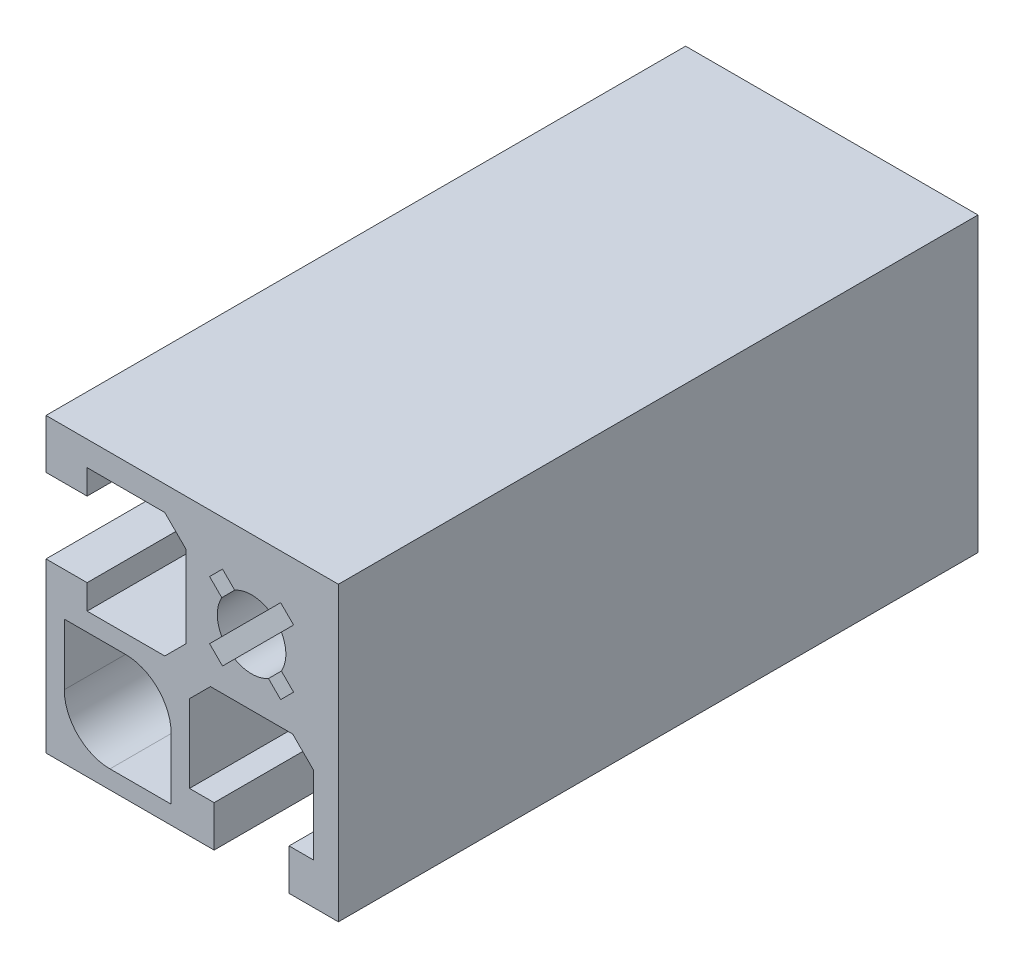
ISO-10303-21;
HEADER;
FILE_DESCRIPTION(('STEP AP214'),'2;1');
FILE_NAME('part.step','',(''),(''),'','','');
FILE_SCHEMA(('AUTOMOTIVE_DESIGN { 1 0 10303 214 1 1 1 1 }'));
ENDSEC;
DATA;
#1=APPLICATION_CONTEXT('core data for automotive mechanical design processes');
#2=APPLICATION_PROTOCOL_DEFINITION('international standard','automotive_design',2000,#1);
#3=PRODUCT_CONTEXT('',#1,'mechanical');
#4=PRODUCT('Part','Part','',(#3));
#5=PRODUCT_RELATED_PRODUCT_CATEGORY('part','',(#4));
#6=PRODUCT_DEFINITION_FORMATION('','',#4);
#7=PRODUCT_DEFINITION_CONTEXT('part definition',#1,'design');
#8=PRODUCT_DEFINITION('design','',#6,#7);
#9=PRODUCT_DEFINITION_SHAPE('','',#8);
#10=(LENGTH_UNIT() NAMED_UNIT(*) SI_UNIT(.MILLI.,.METRE.));
#11=(NAMED_UNIT(*) PLANE_ANGLE_UNIT() SI_UNIT($,.RADIAN.));
#12=(NAMED_UNIT(*) SI_UNIT($,.STERADIAN.) SOLID_ANGLE_UNIT());
#13=UNCERTAINTY_MEASURE_WITH_UNIT(LENGTH_MEASURE(1.E-05),#10,'distance_accuracy_value','');
#14=(GEOMETRIC_REPRESENTATION_CONTEXT(3) GLOBAL_UNCERTAINTY_ASSIGNED_CONTEXT((#13)) GLOBAL_UNIT_ASSIGNED_CONTEXT((#10,
#11,#12)) REPRESENTATION_CONTEXT('',''));
#15=CARTESIAN_POINT('',(0.,0.,0.));
#16=DIRECTION('',(0.,0.,1.));
#17=DIRECTION('',(1.,0.,0.));
#18=AXIS2_PLACEMENT_3D('',#15,#16,#17);
#19=CARTESIAN_POINT('',(-22.5,-4.1,-35.));
#20=DIRECTION('',(-1.,0.,0.));
#21=DIRECTION('',(0.,-1.,0.));
#22=AXIS2_PLACEMENT_3D('',#19,#20,#21);
#23=PLANE('',#22);
#24=DIRECTION('',(0.,0.,1.));
#25=VECTOR('',#24,1.);
#26=CARTESIAN_POINT('',(-22.5,-22.5,-35.));
#27=LINE('',#26,#25);
#28=CARTESIAN_POINT('',(-22.5,-22.5,-35.));
#29=VERTEX_POINT('',#28);
#30=CARTESIAN_POINT('',(-22.5,-22.5,35.));
#31=VERTEX_POINT('',#30);
#32=EDGE_CURVE('E33',#29,#31,#27,.T.);
#33=ORIENTED_EDGE('',*,*,#32,.T.);
#34=DIRECTION('',(0.,-1.,0.));
#35=VECTOR('',#34,1.);
#36=CARTESIAN_POINT('',(-22.5,-4.1,35.));
#37=LINE('',#36,#35);
#38=CARTESIAN_POINT('',(-22.5,-4.1,35.));
#39=VERTEX_POINT('',#38);
#40=EDGE_CURVE('E408',#39,#31,#37,.T.);
#41=ORIENTED_EDGE('',*,*,#40,.F.);
#42=DIRECTION('',(0.,0.,1.));
#43=VECTOR('',#42,1.);
#44=CARTESIAN_POINT('',(-22.5,-4.1,-35.));
#45=LINE('',#44,#43);
#46=CARTESIAN_POINT('',(-22.5,-4.1,-35.));
#47=VERTEX_POINT('',#46);
#48=EDGE_CURVE('E11',#47,#39,#45,.T.);
#49=ORIENTED_EDGE('',*,*,#48,.F.);
#50=DIRECTION('',(0.,-1.,0.));
#51=VECTOR('',#50,1.);
#52=CARTESIAN_POINT('',(-22.5,-4.1,-35.));
#53=LINE('',#52,#51);
#54=EDGE_CURVE('E569',#47,#29,#53,.T.);
#55=ORIENTED_EDGE('',*,*,#54,.T.);
#56=EDGE_LOOP('',(#33,#41,#49,#55));
#57=FACE_BOUND('',#56,.T.);
#58=ADVANCED_FACE('F30',(#57),#23,.T.);
#59=CARTESIAN_POINT('',(-18.,-4.10000000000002,-35.));
#60=DIRECTION('',(0.,1.,0.));
#61=DIRECTION('',(-1.,0.,0.));
#62=AXIS2_PLACEMENT_3D('',#59,#60,#61);
#63=PLANE('',#62);
#64=ORIENTED_EDGE('',*,*,#48,.T.);
#65=DIRECTION('',(-1.,0.,0.));
#66=VECTOR('',#65,1.);
#67=CARTESIAN_POINT('',(-18.,-4.10000000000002,35.));
#68=LINE('',#67,#66);
#69=CARTESIAN_POINT('',(-18.,-4.10000000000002,35.));
#70=VERTEX_POINT('',#69);
#71=EDGE_CURVE('E477',#70,#39,#68,.T.);
#72=ORIENTED_EDGE('',*,*,#71,.F.);
#73=DIRECTION('',(0.,0.,1.));
#74=VECTOR('',#73,1.);
#75=CARTESIAN_POINT('',(-18.,-4.10000000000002,-35.));
#76=LINE('',#75,#74);
#77=CARTESIAN_POINT('',(-18.,-4.10000000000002,-35.));
#78=VERTEX_POINT('',#77);
#79=EDGE_CURVE('E38',#78,#70,#76,.T.);
#80=ORIENTED_EDGE('',*,*,#79,.F.);
#81=DIRECTION('',(-1.,0.,0.));
#82=VECTOR('',#81,1.);
#83=CARTESIAN_POINT('',(-18.,-4.10000000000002,-35.));
#84=LINE('',#83,#82);
#85=EDGE_CURVE('E647',#78,#47,#84,.T.);
#86=ORIENTED_EDGE('',*,*,#85,.T.);
#87=EDGE_LOOP('',(#64,#72,#80,#86));
#88=FACE_BOUND('',#87,.T.);
#89=ADVANCED_FACE('F703',(#88),#63,.T.);
#90=CARTESIAN_POINT('',(-18.,-6.8,-35.));
#91=DIRECTION('',(1.,0.,0.));
#92=DIRECTION('',(0.,0.,-1.));
#93=AXIS2_PLACEMENT_3D('',#90,#91,#92);
#94=PLANE('',#93);
#95=ORIENTED_EDGE('',*,*,#79,.T.);
#96=DIRECTION('',(0.,1.,0.));
#97=VECTOR('',#96,1.);
#98=CARTESIAN_POINT('',(-18.,-6.8,35.));
#99=LINE('',#98,#97);
#100=CARTESIAN_POINT('',(-18.,-6.8,35.));
#101=VERTEX_POINT('',#100);
#102=EDGE_CURVE('E474',#101,#70,#99,.T.);
#103=ORIENTED_EDGE('',*,*,#102,.F.);
#104=DIRECTION('',(0.,0.,1.));
#105=VECTOR('',#104,1.);
#106=CARTESIAN_POINT('',(-18.,-6.8,-35.));
#107=LINE('',#106,#105);
#108=CARTESIAN_POINT('',(-18.,-6.8,-35.));
#109=VERTEX_POINT('',#108);
#110=EDGE_CURVE('E651',#109,#101,#107,.T.);
#111=ORIENTED_EDGE('',*,*,#110,.F.);
#112=DIRECTION('',(0.,1.,0.));
#113=VECTOR('',#112,1.);
#114=CARTESIAN_POINT('',(-18.,-6.8,-35.));
#115=LINE('',#114,#113);
#116=EDGE_CURVE('E644',#109,#78,#115,.T.);
#117=ORIENTED_EDGE('',*,*,#116,.T.);
#118=EDGE_LOOP('',(#95,#103,#111,#117));
#119=FACE_BOUND('',#118,.T.);
#120=ADVANCED_FACE('F788',(#119),#94,.T.);
#121=CARTESIAN_POINT('',(-9.5,-6.79999999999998,-35.));
#122=DIRECTION('',(0.,1.,0.));
#123=DIRECTION('',(-1.,0.,0.));
#124=AXIS2_PLACEMENT_3D('',#121,#122,#123);
#125=PLANE('',#124);
#126=ORIENTED_EDGE('',*,*,#110,.T.);
#127=DIRECTION('',(-1.,0.,0.));
#128=VECTOR('',#127,1.);
#129=CARTESIAN_POINT('',(-9.5,-6.79999999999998,35.));
#130=LINE('',#129,#128);
#131=CARTESIAN_POINT('',(-9.5,-6.79999999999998,35.));
#132=VERTEX_POINT('',#131);
#133=EDGE_CURVE('E471',#132,#101,#130,.T.);
#134=ORIENTED_EDGE('',*,*,#133,.F.);
#135=DIRECTION('',(0.,0.,1.));
#136=VECTOR('',#135,1.);
#137=CARTESIAN_POINT('',(-9.5,-6.79999999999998,-35.));
#138=LINE('',#137,#136);
#139=CARTESIAN_POINT('',(-9.5,-6.79999999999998,-35.));
#140=VERTEX_POINT('',#139);
#141=EDGE_CURVE('E653',#140,#132,#138,.T.);
#142=ORIENTED_EDGE('',*,*,#141,.F.);
#143=DIRECTION('',(-1.,0.,0.));
#144=VECTOR('',#143,1.);
#145=CARTESIAN_POINT('',(-9.5,-6.79999999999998,-35.));
#146=LINE('',#145,#144);
#147=EDGE_CURVE('E641',#140,#109,#146,.T.);
#148=ORIENTED_EDGE('',*,*,#147,.T.);
#149=EDGE_LOOP('',(#126,#134,#142,#148));
#150=FACE_BOUND('',#149,.T.);
#151=ADVANCED_FACE('F786',(#150),#125,.T.);
#152=CARTESIAN_POINT('',(-7.19999999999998,-4.49999999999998,-35.));
#153=DIRECTION('',(-0.707106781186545,0.70710678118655,0.));
#154=DIRECTION('',(-0.70710678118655,-0.707106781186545,0.));
#155=AXIS2_PLACEMENT_3D('',#152,#153,#154);
#156=PLANE('',#155);
#157=ORIENTED_EDGE('',*,*,#141,.T.);
#158=DIRECTION('',(-0.70710678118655,-0.707106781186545,0.));
#159=VECTOR('',#158,1.);
#160=CARTESIAN_POINT('',(-7.19999999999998,-4.49999999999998,35.));
#161=LINE('',#160,#159);
#162=CARTESIAN_POINT('',(-7.19999999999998,-4.49999999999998,35.));
#163=VERTEX_POINT('',#162);
#164=EDGE_CURVE('E468',#163,#132,#161,.T.);
#165=ORIENTED_EDGE('',*,*,#164,.F.);
#166=DIRECTION('',(0.,0.,1.));
#167=VECTOR('',#166,1.);
#168=CARTESIAN_POINT('',(-7.19999999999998,-4.49999999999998,-35.));
#169=LINE('',#168,#167);
#170=CARTESIAN_POINT('',(-7.19999999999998,-4.49999999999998,-35.));
#171=VERTEX_POINT('',#170);
#172=EDGE_CURVE('E655',#171,#163,#169,.T.);
#173=ORIENTED_EDGE('',*,*,#172,.F.);
#174=DIRECTION('',(-0.70710678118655,-0.707106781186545,0.));
#175=VECTOR('',#174,1.);
#176=CARTESIAN_POINT('',(-7.19999999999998,-4.49999999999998,-35.));
#177=LINE('',#176,#175);
#178=EDGE_CURVE('E638',#171,#140,#177,.T.);
#179=ORIENTED_EDGE('',*,*,#178,.T.);
#180=EDGE_LOOP('',(#157,#165,#173,#179));
#181=FACE_BOUND('',#180,.T.);
#182=ADVANCED_FACE('F782',(#181),#156,.T.);
#183=CARTESIAN_POINT('',(-7.19999999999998,4.50000000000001,-35.));
#184=DIRECTION('',(-1.,0.,0.));
#185=DIRECTION('',(0.,-1.,0.));
#186=AXIS2_PLACEMENT_3D('',#183,#184,#185);
#187=PLANE('',#186);
#188=ORIENTED_EDGE('',*,*,#172,.T.);
#189=DIRECTION('',(0.,-1.,0.));
#190=VECTOR('',#189,1.);
#191=CARTESIAN_POINT('',(-7.19999999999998,4.50000000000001,35.));
#192=LINE('',#191,#190);
#193=CARTESIAN_POINT('',(-7.19999999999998,4.50000000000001,35.));
#194=VERTEX_POINT('',#193);
#195=EDGE_CURVE('E465',#194,#163,#192,.T.);
#196=ORIENTED_EDGE('',*,*,#195,.F.);
#197=DIRECTION('',(0.,0.,1.));
#198=VECTOR('',#197,1.);
#199=CARTESIAN_POINT('',(-7.19999999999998,4.50000000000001,-35.));
#200=LINE('',#199,#198);
#201=CARTESIAN_POINT('',(-7.19999999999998,4.50000000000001,-35.));
#202=VERTEX_POINT('',#201);
#203=EDGE_CURVE('E657',#202,#194,#200,.T.);
#204=ORIENTED_EDGE('',*,*,#203,.F.);
#205=DIRECTION('',(0.,-1.,0.));
#206=VECTOR('',#205,1.);
#207=CARTESIAN_POINT('',(-7.19999999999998,4.50000000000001,-35.));
#208=LINE('',#207,#206);
#209=EDGE_CURVE('E635',#202,#171,#208,.T.);
#210=ORIENTED_EDGE('',*,*,#209,.T.);
#211=EDGE_LOOP('',(#188,#196,#204,#210));
#212=FACE_BOUND('',#211,.T.);
#213=ADVANCED_FACE('F778',(#212),#187,.T.);
#214=CARTESIAN_POINT('',(-9.5,6.80000000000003,-35.));
#215=DIRECTION('',(-0.707106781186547,-0.707106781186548,0.));
#216=DIRECTION('',(0.707106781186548,-0.707106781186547,0.));
#217=AXIS2_PLACEMENT_3D('',#214,#215,#216);
#218=PLANE('',#217);
#219=ORIENTED_EDGE('',*,*,#203,.T.);
#220=DIRECTION('',(0.707106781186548,-0.707106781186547,0.));
#221=VECTOR('',#220,1.);
#222=CARTESIAN_POINT('',(-9.5,6.80000000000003,35.));
#223=LINE('',#222,#221);
#224=CARTESIAN_POINT('',(-9.5,6.80000000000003,35.));
#225=VERTEX_POINT('',#224);
#226=EDGE_CURVE('E462',#225,#194,#223,.T.);
#227=ORIENTED_EDGE('',*,*,#226,.F.);
#228=DIRECTION('',(0.,0.,1.));
#229=VECTOR('',#228,1.);
#230=CARTESIAN_POINT('',(-9.5,6.80000000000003,-35.));
#231=LINE('',#230,#229);
#232=CARTESIAN_POINT('',(-9.5,6.80000000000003,-35.));
#233=VERTEX_POINT('',#232);
#234=EDGE_CURVE('E659',#233,#225,#231,.T.);
#235=ORIENTED_EDGE('',*,*,#234,.F.);
#236=DIRECTION('',(0.707106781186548,-0.707106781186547,0.));
#237=VECTOR('',#236,1.);
#238=CARTESIAN_POINT('',(-9.5,6.80000000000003,-35.));
#239=LINE('',#238,#237);
#240=EDGE_CURVE('E632',#233,#202,#239,.T.);
#241=ORIENTED_EDGE('',*,*,#240,.T.);
#242=EDGE_LOOP('',(#219,#227,#235,#241));
#243=FACE_BOUND('',#242,.T.);
#244=ADVANCED_FACE('F776',(#243),#218,.T.);
#245=CARTESIAN_POINT('',(-18.,6.80000000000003,-35.));
#246=DIRECTION('',(0.,-1.,0.));
#247=DIRECTION('',(1.,0.,0.));
#248=AXIS2_PLACEMENT_3D('',#245,#246,#247);
#249=PLANE('',#248);
#250=ORIENTED_EDGE('',*,*,#234,.T.);
#251=DIRECTION('',(1.,0.,0.));
#252=VECTOR('',#251,1.);
#253=CARTESIAN_POINT('',(-18.,6.80000000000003,35.));
#254=LINE('',#253,#252);
#255=CARTESIAN_POINT('',(-18.,6.80000000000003,35.));
#256=VERTEX_POINT('',#255);
#257=EDGE_CURVE('E459',#256,#225,#254,.T.);
#258=ORIENTED_EDGE('',*,*,#257,.F.);
#259=DIRECTION('',(0.,0.,1.));
#260=VECTOR('',#259,1.);
#261=CARTESIAN_POINT('',(-18.,6.80000000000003,-35.));
#262=LINE('',#261,#260);
#263=CARTESIAN_POINT('',(-18.,6.80000000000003,-35.));
#264=VERTEX_POINT('',#263);
#265=EDGE_CURVE('E661',#264,#256,#262,.T.);
#266=ORIENTED_EDGE('',*,*,#265,.F.);
#267=DIRECTION('',(1.,0.,0.));
#268=VECTOR('',#267,1.);
#269=CARTESIAN_POINT('',(-18.,6.80000000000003,-35.));
#270=LINE('',#269,#268);
#271=EDGE_CURVE('E629',#264,#233,#270,.T.);
#272=ORIENTED_EDGE('',*,*,#271,.T.);
#273=EDGE_LOOP('',(#250,#258,#266,#272));
#274=FACE_BOUND('',#273,.T.);
#275=ADVANCED_FACE('F771',(#274),#249,.T.);
#276=CARTESIAN_POINT('',(-18.,4.10000000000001,-35.));
#277=DIRECTION('',(1.,0.,0.));
#278=DIRECTION('',(0.,0.,-1.));
#279=AXIS2_PLACEMENT_3D('',#276,#277,#278);
#280=PLANE('',#279);
#281=ORIENTED_EDGE('',*,*,#265,.T.);
#282=DIRECTION('',(0.,1.,0.));
#283=VECTOR('',#282,1.);
#284=CARTESIAN_POINT('',(-18.,4.10000000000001,35.));
#285=LINE('',#284,#283);
#286=CARTESIAN_POINT('',(-18.,4.10000000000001,35.));
#287=VERTEX_POINT('',#286);
#288=EDGE_CURVE('E456',#287,#256,#285,.T.);
#289=ORIENTED_EDGE('',*,*,#288,.F.);
#290=DIRECTION('',(0.,0.,1.));
#291=VECTOR('',#290,1.);
#292=CARTESIAN_POINT('',(-18.,4.10000000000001,-35.));
#293=LINE('',#292,#291);
#294=CARTESIAN_POINT('',(-18.,4.10000000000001,-35.));
#295=VERTEX_POINT('',#294);
#296=EDGE_CURVE('E663',#295,#287,#293,.T.);
#297=ORIENTED_EDGE('',*,*,#296,.F.);
#298=DIRECTION('',(0.,1.,0.));
#299=VECTOR('',#298,1.);
#300=CARTESIAN_POINT('',(-18.,4.10000000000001,-35.));
#301=LINE('',#300,#299);
#302=EDGE_CURVE('E626',#295,#264,#301,.T.);
#303=ORIENTED_EDGE('',*,*,#302,.T.);
#304=EDGE_LOOP('',(#281,#289,#297,#303));
#305=FACE_BOUND('',#304,.T.);
#306=ADVANCED_FACE('F766',(#305),#280,.T.);
#307=CARTESIAN_POINT('',(-22.5,4.10000000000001,-35.));
#308=DIRECTION('',(0.,-1.,0.));
#309=DIRECTION('',(0.,0.,-1.));
#310=AXIS2_PLACEMENT_3D('',#307,#308,#309);
#311=PLANE('',#310);
#312=ORIENTED_EDGE('',*,*,#296,.T.);
#313=DIRECTION('',(1.,0.,0.));
#314=VECTOR('',#313,1.);
#315=CARTESIAN_POINT('',(-22.5,4.10000000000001,35.));
#316=LINE('',#315,#314);
#317=CARTESIAN_POINT('',(-22.5,4.10000000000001,35.));
#318=VERTEX_POINT('',#317);
#319=EDGE_CURVE('E453',#318,#287,#316,.T.);
#320=ORIENTED_EDGE('',*,*,#319,.F.);
#321=DIRECTION('',(0.,0.,1.));
#322=VECTOR('',#321,1.);
#323=CARTESIAN_POINT('',(-22.5,4.10000000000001,-35.));
#324=LINE('',#323,#322);
#325=CARTESIAN_POINT('',(-22.5,4.10000000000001,-35.));
#326=VERTEX_POINT('',#325);
#327=EDGE_CURVE('E665',#326,#318,#324,.T.);
#328=ORIENTED_EDGE('',*,*,#327,.F.);
#329=DIRECTION('',(1.,0.,0.));
#330=VECTOR('',#329,1.);
#331=CARTESIAN_POINT('',(-22.5,4.10000000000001,-35.));
#332=LINE('',#331,#330);
#333=EDGE_CURVE('E623',#326,#295,#332,.T.);
#334=ORIENTED_EDGE('',*,*,#333,.T.);
#335=EDGE_LOOP('',(#312,#320,#328,#334));
#336=FACE_BOUND('',#335,.T.);
#337=ADVANCED_FACE('F764',(#336),#311,.T.);
#338=CARTESIAN_POINT('',(-22.5,9.50000000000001,-35.));
#339=DIRECTION('',(-1.,0.,0.));
#340=DIRECTION('',(0.,0.,1.));
#341=AXIS2_PLACEMENT_3D('',#338,#339,#340);
#342=PLANE('',#341);
#343=ORIENTED_EDGE('',*,*,#327,.T.);
#344=DIRECTION('',(0.,-1.,0.));
#345=VECTOR('',#344,1.);
#346=CARTESIAN_POINT('',(-22.5,9.50000000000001,35.));
#347=LINE('',#346,#345);
#348=CARTESIAN_POINT('',(-22.5,9.50000000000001,35.));
#349=VERTEX_POINT('',#348);
#350=EDGE_CURVE('E450',#349,#318,#347,.T.);
#351=ORIENTED_EDGE('',*,*,#350,.F.);
#352=DIRECTION('',(0.,0.,1.));
#353=VECTOR('',#352,1.);
#354=CARTESIAN_POINT('',(-22.5,9.50000000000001,-35.));
#355=LINE('',#354,#353);
#356=CARTESIAN_POINT('',(-22.5,9.50000000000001,-35.));
#357=VERTEX_POINT('',#356);
#358=EDGE_CURVE('E667',#357,#349,#355,.T.);
#359=ORIENTED_EDGE('',*,*,#358,.F.);
#360=DIRECTION('',(0.,-1.,0.));
#361=VECTOR('',#360,1.);
#362=CARTESIAN_POINT('',(-22.5,9.50000000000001,-35.));
#363=LINE('',#362,#361);
#364=EDGE_CURVE('E620',#357,#326,#363,.T.);
#365=ORIENTED_EDGE('',*,*,#364,.T.);
#366=EDGE_LOOP('',(#343,#351,#359,#365));
#367=FACE_BOUND('',#366,.T.);
#368=ADVANCED_FACE('F759',(#367),#342,.T.);
#369=CARTESIAN_POINT('',(9.50000000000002,9.50000000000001,-35.));
#370=DIRECTION('',(0.,1.,0.));
#371=DIRECTION('',(-1.,0.,0.));
#372=AXIS2_PLACEMENT_3D('',#369,#370,#371);
#373=PLANE('',#372);
#374=ORIENTED_EDGE('',*,*,#358,.T.);
#375=DIRECTION('',(-1.,0.,0.));
#376=VECTOR('',#375,1.);
#377=CARTESIAN_POINT('',(9.50000000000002,9.50000000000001,35.));
#378=LINE('',#377,#376);
#379=CARTESIAN_POINT('',(9.50000000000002,9.50000000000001,35.));
#380=VERTEX_POINT('',#379);
#381=EDGE_CURVE('E447',#380,#349,#378,.T.);
#382=ORIENTED_EDGE('',*,*,#381,.F.);
#383=DIRECTION('',(0.,0.,1.));
#384=VECTOR('',#383,1.);
#385=CARTESIAN_POINT('',(9.50000000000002,9.50000000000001,-35.));
#386=LINE('',#385,#384);
#387=CARTESIAN_POINT('',(9.50000000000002,9.50000000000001,-35.));
#388=VERTEX_POINT('',#387);
#389=EDGE_CURVE('E669',#388,#380,#386,.T.);
#390=ORIENTED_EDGE('',*,*,#389,.F.);
#391=DIRECTION('',(-1.,0.,0.));
#392=VECTOR('',#391,1.);
#393=CARTESIAN_POINT('',(9.50000000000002,9.50000000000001,-35.));
#394=LINE('',#393,#392);
#395=EDGE_CURVE('E617',#388,#357,#394,.T.);
#396=ORIENTED_EDGE('',*,*,#395,.T.);
#397=EDGE_LOOP('',(#374,#382,#390,#396));
#398=FACE_BOUND('',#397,.T.);
#399=ADVANCED_FACE('F754',(#398),#373,.T.);
#400=CARTESIAN_POINT('',(9.50000000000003,-22.5,-35.));
#401=DIRECTION('',(1.,0.,0.));
#402=DIRECTION('',(0.,1.,0.));
#403=AXIS2_PLACEMENT_3D('',#400,#401,#402);
#404=PLANE('',#403);
#405=ORIENTED_EDGE('',*,*,#389,.T.);
#406=DIRECTION('',(0.,1.,0.));
#407=VECTOR('',#406,1.);
#408=CARTESIAN_POINT('',(9.50000000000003,-22.5,35.));
#409=LINE('',#408,#407);
#410=CARTESIAN_POINT('',(9.50000000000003,-22.5,35.));
#411=VERTEX_POINT('',#410);
#412=EDGE_CURVE('E444',#411,#380,#409,.T.);
#413=ORIENTED_EDGE('',*,*,#412,.F.);
#414=DIRECTION('',(0.,0.,1.));
#415=VECTOR('',#414,1.);
#416=CARTESIAN_POINT('',(9.50000000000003,-22.5,-35.));
#417=LINE('',#416,#415);
#418=CARTESIAN_POINT('',(9.50000000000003,-22.5,-35.));
#419=VERTEX_POINT('',#418);
#420=EDGE_CURVE('E671',#419,#411,#417,.T.);
#421=ORIENTED_EDGE('',*,*,#420,.F.);
#422=DIRECTION('',(0.,1.,0.));
#423=VECTOR('',#422,1.);
#424=CARTESIAN_POINT('',(9.50000000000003,-22.5,-35.));
#425=LINE('',#424,#423);
#426=EDGE_CURVE('E614',#419,#388,#425,.T.);
#427=ORIENTED_EDGE('',*,*,#426,.T.);
#428=EDGE_LOOP('',(#405,#413,#421,#427));
#429=FACE_BOUND('',#428,.T.);
#430=ADVANCED_FACE('F752',(#429),#404,.T.);
#431=CARTESIAN_POINT('',(4.10000000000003,-22.5,-35.));
#432=DIRECTION('',(0.,-1.,0.));
#433=DIRECTION('',(1.,0.,0.));
#434=AXIS2_PLACEMENT_3D('',#431,#432,#433);
#435=PLANE('',#434);
#436=ORIENTED_EDGE('',*,*,#420,.T.);
#437=DIRECTION('',(1.,0.,0.));
#438=VECTOR('',#437,1.);
#439=CARTESIAN_POINT('',(4.10000000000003,-22.5,35.));
#440=LINE('',#439,#438);
#441=CARTESIAN_POINT('',(4.10000000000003,-22.5,35.));
#442=VERTEX_POINT('',#441);
#443=EDGE_CURVE('E441',#442,#411,#440,.T.);
#444=ORIENTED_EDGE('',*,*,#443,.F.);
#445=DIRECTION('',(0.,0.,1.));
#446=VECTOR('',#445,1.);
#447=CARTESIAN_POINT('',(4.10000000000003,-22.5,-35.));
#448=LINE('',#447,#446);
#449=CARTESIAN_POINT('',(4.10000000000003,-22.5,-35.));
#450=VERTEX_POINT('',#449);
#451=EDGE_CURVE('E673',#450,#442,#448,.T.);
#452=ORIENTED_EDGE('',*,*,#451,.F.);
#453=DIRECTION('',(1.,0.,0.));
#454=VECTOR('',#453,1.);
#455=CARTESIAN_POINT('',(4.10000000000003,-22.5,-35.));
#456=LINE('',#455,#454);
#457=EDGE_CURVE('E611',#450,#419,#456,.T.);
#458=ORIENTED_EDGE('',*,*,#457,.T.);
#459=EDGE_LOOP('',(#436,#444,#452,#458));
#460=FACE_BOUND('',#459,.T.);
#461=ADVANCED_FACE('F747',(#460),#435,.T.);
#462=CARTESIAN_POINT('',(4.10000000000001,-18.,-35.));
#463=DIRECTION('',(-1.,0.,0.));
#464=DIRECTION('',(0.,-1.,0.));
#465=AXIS2_PLACEMENT_3D('',#462,#463,#464);
#466=PLANE('',#465);
#467=ORIENTED_EDGE('',*,*,#451,.T.);
#468=DIRECTION('',(0.,-1.,0.));
#469=VECTOR('',#468,1.);
#470=CARTESIAN_POINT('',(4.10000000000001,-18.,35.));
#471=LINE('',#470,#469);
#472=CARTESIAN_POINT('',(4.10000000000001,-18.,35.));
#473=VERTEX_POINT('',#472);
#474=EDGE_CURVE('E438',#473,#442,#471,.T.);
#475=ORIENTED_EDGE('',*,*,#474,.F.);
#476=DIRECTION('',(0.,0.,1.));
#477=VECTOR('',#476,1.);
#478=CARTESIAN_POINT('',(4.10000000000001,-18.,-35.));
#479=LINE('',#478,#477);
#480=CARTESIAN_POINT('',(4.10000000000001,-18.,-35.));
#481=VERTEX_POINT('',#480);
#482=EDGE_CURVE('E675',#481,#473,#479,.T.);
#483=ORIENTED_EDGE('',*,*,#482,.F.);
#484=DIRECTION('',(0.,-1.,0.));
#485=VECTOR('',#484,1.);
#486=CARTESIAN_POINT('',(4.10000000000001,-18.,-35.));
#487=LINE('',#486,#485);
#488=EDGE_CURVE('E608',#481,#450,#487,.T.);
#489=ORIENTED_EDGE('',*,*,#488,.T.);
#490=EDGE_LOOP('',(#467,#475,#483,#489));
#491=FACE_BOUND('',#490,.T.);
#492=ADVANCED_FACE('F742',(#491),#466,.T.);
#493=CARTESIAN_POINT('',(6.80000000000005,-18.,-35.));
#494=DIRECTION('',(0.,1.,0.));
#495=DIRECTION('',(0.,0.,1.));
#496=AXIS2_PLACEMENT_3D('',#493,#494,#495);
#497=PLANE('',#496);
#498=ORIENTED_EDGE('',*,*,#482,.T.);
#499=DIRECTION('',(-1.,0.,0.));
#500=VECTOR('',#499,1.);
#501=CARTESIAN_POINT('',(6.80000000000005,-18.,35.));
#502=LINE('',#501,#500);
#503=CARTESIAN_POINT('',(6.80000000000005,-18.,35.));
#504=VERTEX_POINT('',#503);
#505=EDGE_CURVE('E435',#504,#473,#502,.T.);
#506=ORIENTED_EDGE('',*,*,#505,.F.);
#507=DIRECTION('',(0.,0.,1.));
#508=VECTOR('',#507,1.);
#509=CARTESIAN_POINT('',(6.80000000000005,-18.,-35.));
#510=LINE('',#509,#508);
#511=CARTESIAN_POINT('',(6.80000000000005,-18.,-35.));
#512=VERTEX_POINT('',#511);
#513=EDGE_CURVE('E677',#512,#504,#510,.T.);
#514=ORIENTED_EDGE('',*,*,#513,.F.);
#515=DIRECTION('',(-1.,0.,0.));
#516=VECTOR('',#515,1.);
#517=CARTESIAN_POINT('',(6.80000000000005,-18.,-35.));
#518=LINE('',#517,#516);
#519=EDGE_CURVE('E605',#512,#481,#518,.T.);
#520=ORIENTED_EDGE('',*,*,#519,.T.);
#521=EDGE_LOOP('',(#498,#506,#514,#520));
#522=FACE_BOUND('',#521,.T.);
#523=ADVANCED_FACE('F740',(#522),#497,.T.);
#524=CARTESIAN_POINT('',(6.80000000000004,-9.49999999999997,-35.));
#525=DIRECTION('',(-1.,0.,0.));
#526=DIRECTION('',(0.,-1.,0.));
#527=AXIS2_PLACEMENT_3D('',#524,#525,#526);
#528=PLANE('',#527);
#529=ORIENTED_EDGE('',*,*,#513,.T.);
#530=DIRECTION('',(0.,-1.,0.));
#531=VECTOR('',#530,1.);
#532=CARTESIAN_POINT('',(6.80000000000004,-9.49999999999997,35.));
#533=LINE('',#532,#531);
#534=CARTESIAN_POINT('',(6.80000000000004,-9.49999999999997,35.));
#535=VERTEX_POINT('',#534);
#536=EDGE_CURVE('E432',#535,#504,#533,.T.);
#537=ORIENTED_EDGE('',*,*,#536,.F.);
#538=DIRECTION('',(0.,0.,1.));
#539=VECTOR('',#538,1.);
#540=CARTESIAN_POINT('',(6.80000000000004,-9.49999999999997,-35.));
#541=LINE('',#540,#539);
#542=CARTESIAN_POINT('',(6.80000000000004,-9.49999999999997,-35.));
#543=VERTEX_POINT('',#542);
#544=EDGE_CURVE('E679',#543,#535,#541,.T.);
#545=ORIENTED_EDGE('',*,*,#544,.F.);
#546=DIRECTION('',(0.,-1.,0.));
#547=VECTOR('',#546,1.);
#548=CARTESIAN_POINT('',(6.80000000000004,-9.49999999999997,-35.));
#549=LINE('',#548,#547);
#550=EDGE_CURVE('E602',#543,#512,#549,.T.);
#551=ORIENTED_EDGE('',*,*,#550,.T.);
#552=EDGE_LOOP('',(#529,#537,#545,#551));
#553=FACE_BOUND('',#552,.T.);
#554=ADVANCED_FACE('F735',(#553),#528,.T.);
#555=CARTESIAN_POINT('',(4.50000000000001,-7.19999999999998,-35.));
#556=DIRECTION('',(-0.707106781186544,-0.707106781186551,0.));
#557=DIRECTION('',(0.707106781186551,-0.707106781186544,0.));
#558=AXIS2_PLACEMENT_3D('',#555,#556,#557);
#559=PLANE('',#558);
#560=ORIENTED_EDGE('',*,*,#544,.T.);
#561=DIRECTION('',(0.707106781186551,-0.707106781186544,0.));
#562=VECTOR('',#561,1.);
#563=CARTESIAN_POINT('',(4.50000000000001,-7.19999999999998,35.));
#564=LINE('',#563,#562);
#565=CARTESIAN_POINT('',(4.50000000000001,-7.19999999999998,35.));
#566=VERTEX_POINT('',#565);
#567=EDGE_CURVE('E429',#566,#535,#564,.T.);
#568=ORIENTED_EDGE('',*,*,#567,.F.);
#569=DIRECTION('',(0.,0.,1.));
#570=VECTOR('',#569,1.);
#571=CARTESIAN_POINT('',(4.50000000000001,-7.19999999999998,-35.));
#572=LINE('',#571,#570);
#573=CARTESIAN_POINT('',(4.50000000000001,-7.19999999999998,-35.));
#574=VERTEX_POINT('',#573);
#575=EDGE_CURVE('E681',#574,#566,#572,.T.);
#576=ORIENTED_EDGE('',*,*,#575,.F.);
#577=DIRECTION('',(0.707106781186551,-0.707106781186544,0.));
#578=VECTOR('',#577,1.);
#579=CARTESIAN_POINT('',(4.50000000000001,-7.19999999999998,-35.));
#580=LINE('',#579,#578);
#581=EDGE_CURVE('E599',#574,#543,#580,.T.);
#582=ORIENTED_EDGE('',*,*,#581,.T.);
#583=EDGE_LOOP('',(#560,#568,#576,#582));
#584=FACE_BOUND('',#583,.T.);
#585=ADVANCED_FACE('F730',(#584),#559,.T.);
#586=CARTESIAN_POINT('',(-4.49999999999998,-7.19999999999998,-35.));
#587=DIRECTION('',(0.,-1.,0.));
#588=DIRECTION('',(1.,0.,0.));
#589=AXIS2_PLACEMENT_3D('',#586,#587,#588);
#590=PLANE('',#589);
#591=ORIENTED_EDGE('',*,*,#575,.T.);
#592=DIRECTION('',(1.,0.,0.));
#593=VECTOR('',#592,1.);
#594=CARTESIAN_POINT('',(-4.49999999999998,-7.19999999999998,35.));
#595=LINE('',#594,#593);
#596=CARTESIAN_POINT('',(-4.49999999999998,-7.19999999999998,35.));
#597=VERTEX_POINT('',#596);
#598=EDGE_CURVE('E426',#597,#566,#595,.T.);
#599=ORIENTED_EDGE('',*,*,#598,.F.);
#600=DIRECTION('',(0.,0.,1.));
#601=VECTOR('',#600,1.);
#602=CARTESIAN_POINT('',(-4.49999999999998,-7.19999999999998,-35.));
#603=LINE('',#602,#601);
#604=CARTESIAN_POINT('',(-4.49999999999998,-7.19999999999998,-35.));
#605=VERTEX_POINT('',#604);
#606=EDGE_CURVE('E683',#605,#597,#603,.T.);
#607=ORIENTED_EDGE('',*,*,#606,.F.);
#608=DIRECTION('',(1.,0.,0.));
#609=VECTOR('',#608,1.);
#610=CARTESIAN_POINT('',(-4.49999999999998,-7.19999999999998,-35.));
#611=LINE('',#610,#609);
#612=EDGE_CURVE('E596',#605,#574,#611,.T.);
#613=ORIENTED_EDGE('',*,*,#612,.T.);
#614=EDGE_LOOP('',(#591,#599,#607,#613));
#615=FACE_BOUND('',#614,.T.);
#616=ADVANCED_FACE('F728',(#615),#590,.T.);
#617=CARTESIAN_POINT('',(-6.79999999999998,-9.49999999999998,-35.));
#618=DIRECTION('',(0.707106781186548,-0.707106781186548,0.));
#619=DIRECTION('',(0.707106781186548,0.707106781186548,0.));
#620=AXIS2_PLACEMENT_3D('',#617,#618,#619);
#621=PLANE('',#620);
#622=ORIENTED_EDGE('',*,*,#606,.T.);
#623=DIRECTION('',(0.707106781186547,0.707106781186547,0.));
#624=VECTOR('',#623,1.);
#625=CARTESIAN_POINT('',(-6.79999999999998,-9.49999999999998,35.));
#626=LINE('',#625,#624);
#627=CARTESIAN_POINT('',(-6.79999999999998,-9.49999999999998,35.));
#628=VERTEX_POINT('',#627);
#629=EDGE_CURVE('E423',#628,#597,#626,.T.);
#630=ORIENTED_EDGE('',*,*,#629,.F.);
#631=DIRECTION('',(0.,0.,1.));
#632=VECTOR('',#631,1.);
#633=CARTESIAN_POINT('',(-6.79999999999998,-9.49999999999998,-35.));
#634=LINE('',#633,#632);
#635=CARTESIAN_POINT('',(-6.79999999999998,-9.49999999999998,-35.));
#636=VERTEX_POINT('',#635);
#637=EDGE_CURVE('E685',#636,#628,#634,.T.);
#638=ORIENTED_EDGE('',*,*,#637,.F.);
#639=DIRECTION('',(0.707106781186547,0.707106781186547,0.));
#640=VECTOR('',#639,1.);
#641=CARTESIAN_POINT('',(-6.79999999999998,-9.49999999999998,-35.));
#642=LINE('',#641,#640);
#643=EDGE_CURVE('E593',#636,#605,#642,.T.);
#644=ORIENTED_EDGE('',*,*,#643,.T.);
#645=EDGE_LOOP('',(#622,#630,#638,#644));
#646=FACE_BOUND('',#645,.T.);
#647=ADVANCED_FACE('F723',(#646),#621,.T.);
#648=CARTESIAN_POINT('',(-6.8,-18.,-35.));
#649=DIRECTION('',(1.,0.,0.));
#650=DIRECTION('',(0.,1.,0.));
#651=AXIS2_PLACEMENT_3D('',#648,#649,#650);
#652=PLANE('',#651);
#653=ORIENTED_EDGE('',*,*,#637,.T.);
#654=DIRECTION('',(0.,1.,0.));
#655=VECTOR('',#654,1.);
#656=CARTESIAN_POINT('',(-6.8,-18.,35.));
#657=LINE('',#656,#655);
#658=CARTESIAN_POINT('',(-6.8,-18.,35.));
#659=VERTEX_POINT('',#658);
#660=EDGE_CURVE('E420',#659,#628,#657,.T.);
#661=ORIENTED_EDGE('',*,*,#660,.F.);
#662=DIRECTION('',(0.,0.,1.));
#663=VECTOR('',#662,1.);
#664=CARTESIAN_POINT('',(-6.8,-18.,-35.));
#665=LINE('',#664,#663);
#666=CARTESIAN_POINT('',(-6.8,-18.,-35.));
#667=VERTEX_POINT('',#666);
#668=EDGE_CURVE('E687',#667,#659,#665,.T.);
#669=ORIENTED_EDGE('',*,*,#668,.F.);
#670=DIRECTION('',(0.,1.,0.));
#671=VECTOR('',#670,1.);
#672=CARTESIAN_POINT('',(-6.8,-18.,-35.));
#673=LINE('',#672,#671);
#674=EDGE_CURVE('E590',#667,#636,#673,.T.);
#675=ORIENTED_EDGE('',*,*,#674,.T.);
#676=EDGE_LOOP('',(#653,#661,#669,#675));
#677=FACE_BOUND('',#676,.T.);
#678=ADVANCED_FACE('F718',(#677),#652,.T.);
#679=CARTESIAN_POINT('',(-4.09999999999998,-18.,-35.));
#680=DIRECTION('',(0.,1.,0.));
#681=DIRECTION('',(0.,0.,1.));
#682=AXIS2_PLACEMENT_3D('',#679,#680,#681);
#683=PLANE('',#682);
#684=ORIENTED_EDGE('',*,*,#668,.T.);
#685=DIRECTION('',(-1.,0.,0.));
#686=VECTOR('',#685,1.);
#687=CARTESIAN_POINT('',(-4.09999999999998,-18.,35.));
#688=LINE('',#687,#686);
#689=CARTESIAN_POINT('',(-4.09999999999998,-18.,35.));
#690=VERTEX_POINT('',#689);
#691=EDGE_CURVE('E417',#690,#659,#688,.T.);
#692=ORIENTED_EDGE('',*,*,#691,.F.);
#693=DIRECTION('',(0.,0.,1.));
#694=VECTOR('',#693,1.);
#695=CARTESIAN_POINT('',(-4.09999999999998,-18.,-35.));
#696=LINE('',#695,#694);
#697=CARTESIAN_POINT('',(-4.09999999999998,-18.,-35.));
#698=VERTEX_POINT('',#697);
#699=EDGE_CURVE('E689',#698,#690,#696,.T.);
#700=ORIENTED_EDGE('',*,*,#699,.F.);
#701=DIRECTION('',(-1.,0.,0.));
#702=VECTOR('',#701,1.);
#703=CARTESIAN_POINT('',(-4.09999999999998,-18.,-35.));
#704=LINE('',#703,#702);
#705=EDGE_CURVE('E587',#698,#667,#704,.T.);
#706=ORIENTED_EDGE('',*,*,#705,.T.);
#707=EDGE_LOOP('',(#684,#692,#700,#706));
#708=FACE_BOUND('',#707,.T.);
#709=ADVANCED_FACE('F716',(#708),#683,.T.);
#710=CARTESIAN_POINT('',(-4.09999999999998,-22.5,-35.));
#711=DIRECTION('',(1.,0.,0.));
#712=DIRECTION('',(0.,0.,-1.));
#713=AXIS2_PLACEMENT_3D('',#710,#711,#712);
#714=PLANE('',#713);
#715=ORIENTED_EDGE('',*,*,#699,.T.);
#716=DIRECTION('',(0.,1.,0.));
#717=VECTOR('',#716,1.);
#718=CARTESIAN_POINT('',(-4.09999999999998,-22.5,35.));
#719=LINE('',#718,#717);
#720=CARTESIAN_POINT('',(-4.09999999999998,-22.5,35.));
#721=VERTEX_POINT('',#720);
#722=EDGE_CURVE('E414',#721,#690,#719,.T.);
#723=ORIENTED_EDGE('',*,*,#722,.F.);
#724=DIRECTION('',(0.,0.,1.));
#725=VECTOR('',#724,1.);
#726=CARTESIAN_POINT('',(-4.09999999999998,-22.5,-35.));
#727=LINE('',#726,#725);
#728=CARTESIAN_POINT('',(-4.09999999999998,-22.5,-35.));
#729=VERTEX_POINT('',#728);
#730=EDGE_CURVE('E690',#729,#721,#727,.T.);
#731=ORIENTED_EDGE('',*,*,#730,.F.);
#732=DIRECTION('',(0.,1.,0.));
#733=VECTOR('',#732,1.);
#734=CARTESIAN_POINT('',(-4.09999999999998,-22.5,-35.));
#735=LINE('',#734,#733);
#736=EDGE_CURVE('E584',#729,#698,#735,.T.);
#737=ORIENTED_EDGE('',*,*,#736,.T.);
#738=EDGE_LOOP('',(#715,#723,#731,#737));
#739=FACE_BOUND('',#738,.T.);
#740=ADVANCED_FACE('F712',(#739),#714,.T.);
#741=CARTESIAN_POINT('',(-22.5,-22.5,-35.));
#742=DIRECTION('',(0.,-1.,0.));
#743=DIRECTION('',(1.,0.,0.));
#744=AXIS2_PLACEMENT_3D('',#741,#742,#743);
#745=PLANE('',#744);
#746=ORIENTED_EDGE('',*,*,#730,.T.);
#747=DIRECTION('',(1.,0.,0.));
#748=VECTOR('',#747,1.);
#749=CARTESIAN_POINT('',(-22.5,-22.5,35.));
#750=LINE('',#749,#748);
#751=EDGE_CURVE('E411',#31,#721,#750,.T.);
#752=ORIENTED_EDGE('',*,*,#751,.F.);
#753=ORIENTED_EDGE('',*,*,#32,.F.);
#754=DIRECTION('',(1.,0.,0.));
#755=VECTOR('',#754,1.);
#756=CARTESIAN_POINT('',(-22.5,-22.5,-35.));
#757=LINE('',#756,#755);
#758=EDGE_CURVE('E581',#29,#729,#757,.T.);
#759=ORIENTED_EDGE('',*,*,#758,.T.);
#760=EDGE_LOOP('',(#746,#752,#753,#759));
#761=FACE_BOUND('',#760,.T.);
#762=ADVANCED_FACE('F697',(#761),#745,.T.);
#763=CARTESIAN_POINT('',(-22.5,-22.5,-35.));
#764=DIRECTION('',(0.,0.,1.));
#765=DIRECTION('',(1.,0.,0.));
#766=AXIS2_PLACEMENT_3D('',#763,#764,#765);
#767=PLANE('',#766);
#768=DIRECTION('',(-0.70710678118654,-0.707106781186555,0.));
#769=VECTOR('',#768,1.);
#770=CARTESIAN_POINT('',(-4.59619407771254,-3.18198051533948,-35.));
#771=LINE('',#770,#769);
#772=CARTESIAN_POINT('',(-3.26273781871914,-1.84852425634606,-35.));
#773=VERTEX_POINT('',#772);
#774=CARTESIAN_POINT('',(-4.59619407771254,-3.18198051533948,-35.));
#775=VERTEX_POINT('',#774);
#776=EDGE_CURVE('E335',#773,#775,#771,.T.);
#777=ORIENTED_EDGE('',*,*,#776,.T.);
#778=DIRECTION('',(0.707106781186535,-0.70710678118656,0.));
#779=VECTOR('',#778,1.);
#780=CARTESIAN_POINT('',(-3.18198051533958,-4.59619407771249,-35.));
#781=LINE('',#780,#779);
#782=CARTESIAN_POINT('',(-3.18198051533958,-4.59619407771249,-35.));
#783=VERTEX_POINT('',#782);
#784=EDGE_CURVE('E480',#775,#783,#781,.T.);
#785=ORIENTED_EDGE('',*,*,#784,.T.);
#786=DIRECTION('',(0.707106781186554,0.707106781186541,0.));
#787=VECTOR('',#786,1.);
#788=CARTESIAN_POINT('',(-1.84852425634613,-3.26273781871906,-35.));
#789=LINE('',#788,#787);
#790=CARTESIAN_POINT('',(-1.84852425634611,-3.26273781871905,-35.));
#791=VERTEX_POINT('',#790);
#792=EDGE_CURVE('E330',#783,#791,#789,.T.);
#793=ORIENTED_EDGE('',*,*,#792,.T.);
#794=CARTESIAN_POINT('',(0.,0.,-35.));
#795=DIRECTION('',(0.,0.,1.));
#796=DIRECTION('',(1.,0.,0.));
#797=AXIS2_PLACEMENT_3D('',#794,#795,#796);
#798=CIRCLE('',#797,3.74999999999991);
#799=CARTESIAN_POINT('',(1.84852425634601,-3.26273781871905,-35.));
#800=VERTEX_POINT('',#799);
#801=EDGE_CURVE('E46',#791,#800,#798,.T.);
#802=ORIENTED_EDGE('',*,*,#801,.T.);
#803=DIRECTION('',(0.707106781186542,-0.707106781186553,0.));
#804=VECTOR('',#803,1.);
#805=CARTESIAN_POINT('',(3.1819805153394,-4.59619407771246,-35.));
#806=LINE('',#805,#804);
#807=CARTESIAN_POINT('',(3.1819805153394,-4.59619407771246,-35.));
#808=VERTEX_POINT('',#807);
#809=EDGE_CURVE('E484',#800,#808,#806,.T.);
#810=ORIENTED_EDGE('',*,*,#809,.T.);
#811=DIRECTION('',(0.707106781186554,0.707106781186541,0.));
#812=VECTOR('',#811,1.);
#813=CARTESIAN_POINT('',(4.59619407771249,-3.1819805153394,-35.));
#814=LINE('',#813,#812);
#815=CARTESIAN_POINT('',(4.59619407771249,-3.1819805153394,-35.));
#816=VERTEX_POINT('',#815);
#817=EDGE_CURVE('E487',#808,#816,#814,.T.);
#818=ORIENTED_EDGE('',*,*,#817,.T.);
#819=DIRECTION('',(-0.707106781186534,0.707106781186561,0.));
#820=VECTOR('',#819,1.);
#821=CARTESIAN_POINT('',(3.26273781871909,-1.84852425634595,-35.));
#822=LINE('',#821,#820);
#823=CARTESIAN_POINT('',(3.26273781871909,-1.84852425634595,-35.));
#824=VERTEX_POINT('',#823);
#825=EDGE_CURVE('E490',#816,#824,#822,.T.);
#826=ORIENTED_EDGE('',*,*,#825,.T.);
#827=CARTESIAN_POINT('',(0.,0.,-35.));
#828=DIRECTION('',(0.,0.,1.));
#829=DIRECTION('',(1.,0.,0.));
#830=AXIS2_PLACEMENT_3D('',#827,#828,#829);
#831=CIRCLE('',#830,3.74999999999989);
#832=CARTESIAN_POINT('',(3.26273781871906,1.84852425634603,-35.));
#833=VERTEX_POINT('',#832);
#834=EDGE_CURVE('E493',#824,#833,#831,.T.);
#835=ORIENTED_EDGE('',*,*,#834,.T.);
#836=DIRECTION('',(0.707106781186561,0.707106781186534,0.));
#837=VECTOR('',#836,1.);
#838=CARTESIAN_POINT('',(4.59619407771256,3.18198051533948,-35.));
#839=LINE('',#838,#837);
#840=CARTESIAN_POINT('',(4.59619407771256,3.18198051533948,-35.));
#841=VERTEX_POINT('',#840);
#842=EDGE_CURVE('E496',#833,#841,#839,.T.);
#843=ORIENTED_EDGE('',*,*,#842,.T.);
#844=DIRECTION('',(-0.707106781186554,0.707106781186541,0.));
#845=VECTOR('',#844,1.);
#846=CARTESIAN_POINT('',(3.18198051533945,4.59619407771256,-35.));
#847=LINE('',#846,#845);
#848=CARTESIAN_POINT('',(3.18198051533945,4.59619407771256,-35.));
#849=VERTEX_POINT('',#848);
#850=EDGE_CURVE('E499',#841,#849,#847,.T.);
#851=ORIENTED_EDGE('',*,*,#850,.T.);
#852=DIRECTION('',(-0.70710678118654,-0.707106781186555,0.));
#853=VECTOR('',#852,1.);
#854=CARTESIAN_POINT('',(1.84852425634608,3.26273781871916,-35.));
#855=LINE('',#854,#853);
#856=CARTESIAN_POINT('',(1.84852425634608,3.26273781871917,-35.));
#857=VERTEX_POINT('',#856);
#858=EDGE_CURVE('E502',#849,#857,#855,.T.);
#859=ORIENTED_EDGE('',*,*,#858,.T.);
#860=CARTESIAN_POINT('',(0.,0.,-35.));
#861=DIRECTION('',(0.,0.,1.));
#862=DIRECTION('',(1.,0.,0.));
#863=AXIS2_PLACEMENT_3D('',#860,#861,#862);
#864=CIRCLE('',#863,3.75000000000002);
#865=CARTESIAN_POINT('',(-1.84852425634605,3.26273781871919,-35.));
#866=VERTEX_POINT('',#865);
#867=EDGE_CURVE('E505',#857,#866,#864,.T.);
#868=ORIENTED_EDGE('',*,*,#867,.T.);
#869=DIRECTION('',(-0.707106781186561,0.707106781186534,0.));
#870=VECTOR('',#869,1.);
#871=CARTESIAN_POINT('',(-3.18198051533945,4.59619407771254,-35.));
#872=LINE('',#871,#870);
#873=CARTESIAN_POINT('',(-3.18198051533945,4.59619407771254,-35.));
#874=VERTEX_POINT('',#873);
#875=EDGE_CURVE('E508',#866,#874,#872,.T.);
#876=ORIENTED_EDGE('',*,*,#875,.T.);
#877=DIRECTION('',(-0.70710678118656,-0.707106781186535,0.));
#878=VECTOR('',#877,1.);
#879=CARTESIAN_POINT('',(-4.59619407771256,3.18198051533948,-35.));
#880=LINE('',#879,#878);
#881=CARTESIAN_POINT('',(-4.59619407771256,3.18198051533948,-35.));
#882=VERTEX_POINT('',#881);
#883=EDGE_CURVE('E511',#874,#882,#880,.T.);
#884=ORIENTED_EDGE('',*,*,#883,.T.);
#885=DIRECTION('',(0.707106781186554,-0.707106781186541,0.));
#886=VECTOR('',#885,1.);
#887=CARTESIAN_POINT('',(-3.26273781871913,1.84852425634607,-35.));
#888=LINE('',#887,#886);
#889=CARTESIAN_POINT('',(-3.26273781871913,1.84852425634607,-35.));
#890=VERTEX_POINT('',#889);
#891=EDGE_CURVE('E514',#882,#890,#888,.T.);
#892=ORIENTED_EDGE('',*,*,#891,.T.);
#893=CARTESIAN_POINT('',(0.,0.,-35.));
#894=DIRECTION('',(0.,0.,1.));
#895=DIRECTION('',(1.,0.,0.));
#896=AXIS2_PLACEMENT_3D('',#893,#894,#895);
#897=CIRCLE('',#896,3.74999999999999);
#898=EDGE_CURVE('E517',#890,#773,#897,.T.);
#899=ORIENTED_EDGE('',*,*,#898,.T.);
#900=EDGE_LOOP('',(#777,#785,#793,#802,#810,#818,#826,#835,#843,#851,#859,#868,#876,#884,#892,#899));
#901=FACE_BOUND('',#900,.T.);
#902=DIRECTION('',(0.,-1.,0.));
#903=VECTOR('',#902,1.);
#904=CARTESIAN_POINT('',(-20.5,-15.5,-35.));
#905=LINE('',#904,#903);
#906=CARTESIAN_POINT('',(-20.5,-8.79999999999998,-35.));
#907=VERTEX_POINT('',#906);
#908=CARTESIAN_POINT('',(-20.5,-15.5,-35.));
#909=VERTEX_POINT('',#908);
#910=EDGE_CURVE('E563',#907,#909,#905,.T.);
#911=ORIENTED_EDGE('',*,*,#910,.T.);
#912=CARTESIAN_POINT('',(-15.5,-15.5,-35.));
#913=DIRECTION('',(0.,0.,1.));
#914=DIRECTION('',(1.,0.,0.));
#915=AXIS2_PLACEMENT_3D('',#912,#913,#914);
#916=CIRCLE('',#915,5.00000000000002);
#917=CARTESIAN_POINT('',(-15.5,-20.5,-35.));
#918=VERTEX_POINT('',#917);
#919=EDGE_CURVE('E523',#909,#918,#916,.T.);
#920=ORIENTED_EDGE('',*,*,#919,.T.);
#921=DIRECTION('',(1.,0.,0.));
#922=VECTOR('',#921,1.);
#923=CARTESIAN_POINT('',(-8.80000000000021,-20.5,-35.));
#924=LINE('',#923,#922);
#925=CARTESIAN_POINT('',(-8.80000000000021,-20.5,-35.));
#926=VERTEX_POINT('',#925);
#927=EDGE_CURVE('E553',#918,#926,#924,.T.);
#928=ORIENTED_EDGE('',*,*,#927,.T.);
#929=DIRECTION('',(0.,1.,0.));
#930=VECTOR('',#929,1.);
#931=CARTESIAN_POINT('',(-8.8000000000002,-13.8,-35.));
#932=LINE('',#931,#930);
#933=CARTESIAN_POINT('',(-8.80000000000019,-13.8,-35.));
#934=VERTEX_POINT('',#933);
#935=EDGE_CURVE('E54',#926,#934,#932,.T.);
#936=ORIENTED_EDGE('',*,*,#935,.T.);
#937=CARTESIAN_POINT('',(-13.8000000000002,-13.8,-35.));
#938=DIRECTION('',(0.,0.,1.));
#939=DIRECTION('',(1.,0.,0.));
#940=AXIS2_PLACEMENT_3D('',#937,#938,#939);
#941=CIRCLE('',#940,5.00000000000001);
#942=CARTESIAN_POINT('',(-13.8000000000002,-8.79999999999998,-35.));
#943=VERTEX_POINT('',#942);
#944=EDGE_CURVE('E557',#934,#943,#941,.T.);
#945=ORIENTED_EDGE('',*,*,#944,.T.);
#946=DIRECTION('',(-1.,0.,0.));
#947=VECTOR('',#946,1.);
#948=CARTESIAN_POINT('',(-20.5,-8.79999999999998,-35.));
#949=LINE('',#948,#947);
#950=EDGE_CURVE('E560',#943,#907,#949,.T.);
#951=ORIENTED_EDGE('',*,*,#950,.T.);
#952=EDGE_LOOP('',(#911,#920,#928,#936,#945,#951));
#953=FACE_BOUND('',#952,.T.);
#954=ORIENTED_EDGE('',*,*,#54,.F.);
#955=ORIENTED_EDGE('',*,*,#85,.F.);
#956=ORIENTED_EDGE('',*,*,#116,.F.);
#957=ORIENTED_EDGE('',*,*,#147,.F.);
#958=ORIENTED_EDGE('',*,*,#178,.F.);
#959=ORIENTED_EDGE('',*,*,#209,.F.);
#960=ORIENTED_EDGE('',*,*,#240,.F.);
#961=ORIENTED_EDGE('',*,*,#271,.F.);
#962=ORIENTED_EDGE('',*,*,#302,.F.);
#963=ORIENTED_EDGE('',*,*,#333,.F.);
#964=ORIENTED_EDGE('',*,*,#364,.F.);
#965=ORIENTED_EDGE('',*,*,#395,.F.);
#966=ORIENTED_EDGE('',*,*,#426,.F.);
#967=ORIENTED_EDGE('',*,*,#457,.F.);
#968=ORIENTED_EDGE('',*,*,#488,.F.);
#969=ORIENTED_EDGE('',*,*,#519,.F.);
#970=ORIENTED_EDGE('',*,*,#550,.F.);
#971=ORIENTED_EDGE('',*,*,#581,.F.);
#972=ORIENTED_EDGE('',*,*,#612,.F.);
#973=ORIENTED_EDGE('',*,*,#643,.F.);
#974=ORIENTED_EDGE('',*,*,#674,.F.);
#975=ORIENTED_EDGE('',*,*,#705,.F.);
#976=ORIENTED_EDGE('',*,*,#736,.F.);
#977=ORIENTED_EDGE('',*,*,#758,.F.);
#978=EDGE_LOOP('',(#954,#955,#956,#957,#958,#959,#960,#961,#962,#963,#964,#965,#966,#967,#968,
#969,#970,#971,#972,#973,#974,#975,#976,#977));
#979=FACE_BOUND('',#978,.T.);
#980=ADVANCED_FACE('F706',(#901,#953,#979),#767,.F.);
#981=CARTESIAN_POINT('',(-15.5,-15.5,-35.));
#982=DIRECTION('',(0.,0.,1.));
#983=DIRECTION('',(1.,0.,0.));
#984=AXIS2_PLACEMENT_3D('',#981,#982,#983);
#985=CYLINDRICAL_SURFACE('',#984,5.00000000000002);
#986=DIRECTION('',(0.,0.,1.));
#987=VECTOR('',#986,1.);
#988=CARTESIAN_POINT('',(-20.5,-15.5,-35.));
#989=LINE('',#988,#987);
#990=CARTESIAN_POINT('',(-20.5,-15.5,35.));
#991=VERTEX_POINT('',#990);
#992=EDGE_CURVE('E567',#909,#991,#989,.T.);
#993=ORIENTED_EDGE('',*,*,#992,.T.);
#994=CARTESIAN_POINT('',(-15.5,-15.5,35.));
#995=DIRECTION('',(0.,0.,1.));
#996=DIRECTION('',(1.,0.,0.));
#997=AXIS2_PLACEMENT_3D('',#994,#995,#996);
#998=CIRCLE('',#997,5.00000000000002);
#999=CARTESIAN_POINT('',(-15.5,-20.5,35.));
#1000=VERTEX_POINT('',#999);
#1001=EDGE_CURVE('E390',#991,#1000,#998,.T.);
#1002=ORIENTED_EDGE('',*,*,#1001,.T.);
#1003=DIRECTION('',(0.,0.,1.));
#1004=VECTOR('',#1003,1.);
#1005=CARTESIAN_POINT('',(-15.5,-20.5,-35.));
#1006=LINE('',#1005,#1004);
#1007=EDGE_CURVE('E566',#918,#1000,#1006,.T.);
#1008=ORIENTED_EDGE('',*,*,#1007,.F.);
#1009=ORIENTED_EDGE('',*,*,#919,.F.);
#1010=EDGE_LOOP('',(#993,#1002,#1008,#1009));
#1011=FACE_BOUND('',#1010,.T.);
#1012=ADVANCED_FACE('F982',(#1011),#985,.F.);
#1013=CARTESIAN_POINT('',(-20.5,-15.5,-35.));
#1014=DIRECTION('',(-1.,0.,0.));
#1015=DIRECTION('',(0.,-1.,0.));
#1016=AXIS2_PLACEMENT_3D('',#1013,#1014,#1015);
#1017=PLANE('',#1016);
#1018=DIRECTION('',(0.,0.,1.));
#1019=VECTOR('',#1018,1.);
#1020=CARTESIAN_POINT('',(-20.5,-8.79999999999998,-35.));
#1021=LINE('',#1020,#1019);
#1022=CARTESIAN_POINT('',(-20.5,-8.79999999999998,35.));
#1023=VERTEX_POINT('',#1022);
#1024=EDGE_CURVE('E570',#907,#1023,#1021,.T.);
#1025=ORIENTED_EDGE('',*,*,#1024,.T.);
#1026=DIRECTION('',(0.,-1.,0.));
#1027=VECTOR('',#1026,1.);
#1028=CARTESIAN_POINT('',(-20.5,-15.5,35.));
#1029=LINE('',#1028,#1027);
#1030=EDGE_CURVE('E405',#1023,#991,#1029,.T.);
#1031=ORIENTED_EDGE('',*,*,#1030,.T.);
#1032=ORIENTED_EDGE('',*,*,#992,.F.);
#1033=ORIENTED_EDGE('',*,*,#910,.F.);
#1034=EDGE_LOOP('',(#1025,#1031,#1032,#1033));
#1035=FACE_BOUND('',#1034,.T.);
#1036=ADVANCED_FACE('F992',(#1035),#1017,.F.);
#1037=CARTESIAN_POINT('',(-20.5,-8.79999999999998,-35.));
#1038=DIRECTION('',(0.,1.,0.));
#1039=DIRECTION('',(-1.,0.,0.));
#1040=AXIS2_PLACEMENT_3D('',#1037,#1038,#1039);
#1041=PLANE('',#1040);
#1042=DIRECTION('',(0.,0.,1.));
#1043=VECTOR('',#1042,1.);
#1044=CARTESIAN_POINT('',(-13.8000000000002,-8.79999999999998,-35.));
#1045=LINE('',#1044,#1043);
#1046=CARTESIAN_POINT('',(-13.8000000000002,-8.79999999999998,35.));
#1047=VERTEX_POINT('',#1046);
#1048=EDGE_CURVE('E572',#943,#1047,#1045,.T.);
#1049=ORIENTED_EDGE('',*,*,#1048,.T.);
#1050=DIRECTION('',(-1.,0.,0.));
#1051=VECTOR('',#1050,1.);
#1052=CARTESIAN_POINT('',(-20.5,-8.79999999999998,35.));
#1053=LINE('',#1052,#1051);
#1054=EDGE_CURVE('E402',#1047,#1023,#1053,.T.);
#1055=ORIENTED_EDGE('',*,*,#1054,.T.);
#1056=ORIENTED_EDGE('',*,*,#1024,.F.);
#1057=ORIENTED_EDGE('',*,*,#950,.F.);
#1058=EDGE_LOOP('',(#1049,#1055,#1056,#1057));
#1059=FACE_BOUND('',#1058,.T.);
#1060=ADVANCED_FACE('F1002',(#1059),#1041,.F.);
#1061=CARTESIAN_POINT('',(-13.8000000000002,-13.8,-35.));
#1062=DIRECTION('',(0.,0.,1.));
#1063=DIRECTION('',(1.,0.,0.));
#1064=AXIS2_PLACEMENT_3D('',#1061,#1062,#1063);
#1065=CYLINDRICAL_SURFACE('',#1064,5.00000000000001);
#1066=DIRECTION('',(0.,0.,1.));
#1067=VECTOR('',#1066,1.);
#1068=CARTESIAN_POINT('',(-8.80000000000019,-13.8,-35.));
#1069=LINE('',#1068,#1067);
#1070=CARTESIAN_POINT('',(-8.80000000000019,-13.8,35.));
#1071=VERTEX_POINT('',#1070);
#1072=EDGE_CURVE('E574',#934,#1071,#1069,.T.);
#1073=ORIENTED_EDGE('',*,*,#1072,.T.);
#1074=CARTESIAN_POINT('',(-13.8000000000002,-13.8,35.));
#1075=DIRECTION('',(0.,0.,1.));
#1076=DIRECTION('',(1.,0.,0.));
#1077=AXIS2_PLACEMENT_3D('',#1074,#1075,#1076);
#1078=CIRCLE('',#1077,5.00000000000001);
#1079=EDGE_CURVE('E399',#1071,#1047,#1078,.T.);
#1080=ORIENTED_EDGE('',*,*,#1079,.T.);
#1081=ORIENTED_EDGE('',*,*,#1048,.F.);
#1082=ORIENTED_EDGE('',*,*,#944,.F.);
#1083=EDGE_LOOP('',(#1073,#1080,#1081,#1082));
#1084=FACE_BOUND('',#1083,.T.);
#1085=ADVANCED_FACE('F1012',(#1084),#1065,.F.);
#1086=CARTESIAN_POINT('',(-8.8000000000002,-13.8,-35.));
#1087=DIRECTION('',(1.,0.,0.));
#1088=DIRECTION('',(0.,1.,0.));
#1089=AXIS2_PLACEMENT_3D('',#1086,#1087,#1088);
#1090=PLANE('',#1089);
#1091=DIRECTION('',(0.,0.,1.));
#1092=VECTOR('',#1091,1.);
#1093=CARTESIAN_POINT('',(-8.80000000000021,-20.5,-35.));
#1094=LINE('',#1093,#1092);
#1095=CARTESIAN_POINT('',(-8.80000000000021,-20.5,35.));
#1096=VERTEX_POINT('',#1095);
#1097=EDGE_CURVE('E576',#926,#1096,#1094,.T.);
#1098=ORIENTED_EDGE('',*,*,#1097,.T.);
#1099=DIRECTION('',(0.,1.,0.));
#1100=VECTOR('',#1099,1.);
#1101=CARTESIAN_POINT('',(-8.8000000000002,-13.8,35.));
#1102=LINE('',#1101,#1100);
#1103=EDGE_CURVE('E396',#1096,#1071,#1102,.T.);
#1104=ORIENTED_EDGE('',*,*,#1103,.T.);
#1105=ORIENTED_EDGE('',*,*,#1072,.F.);
#1106=ORIENTED_EDGE('',*,*,#935,.F.);
#1107=EDGE_LOOP('',(#1098,#1104,#1105,#1106));
#1108=FACE_BOUND('',#1107,.T.);
#1109=ADVANCED_FACE('F1022',(#1108),#1090,.F.);
#1110=CARTESIAN_POINT('',(-8.80000000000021,-20.5,-35.));
#1111=DIRECTION('',(0.,-1.,0.));
#1112=DIRECTION('',(0.,0.,-1.));
#1113=AXIS2_PLACEMENT_3D('',#1110,#1111,#1112);
#1114=PLANE('',#1113);
#1115=ORIENTED_EDGE('',*,*,#1007,.T.);
#1116=DIRECTION('',(1.,0.,0.));
#1117=VECTOR('',#1116,1.);
#1118=CARTESIAN_POINT('',(-8.80000000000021,-20.5,35.));
#1119=LINE('',#1118,#1117);
#1120=EDGE_CURVE('E393',#1000,#1096,#1119,.T.);
#1121=ORIENTED_EDGE('',*,*,#1120,.T.);
#1122=ORIENTED_EDGE('',*,*,#1097,.F.);
#1123=ORIENTED_EDGE('',*,*,#927,.F.);
#1124=EDGE_LOOP('',(#1115,#1121,#1122,#1123));
#1125=FACE_BOUND('',#1124,.T.);
#1126=ADVANCED_FACE('F1032',(#1125),#1114,.F.);
#1127=CARTESIAN_POINT('',(-3.18198051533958,-4.59619407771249,-35.));
#1128=DIRECTION('',(-0.70710678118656,-0.707106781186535,0.));
#1129=DIRECTION('',(0.707106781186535,-0.70710678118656,0.));
#1130=AXIS2_PLACEMENT_3D('',#1127,#1128,#1129);
#1131=PLANE('',#1130);
#1132=DIRECTION('',(0.,0.,1.));
#1133=VECTOR('',#1132,1.);
#1134=CARTESIAN_POINT('',(-4.59619407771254,-3.18198051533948,-35.));
#1135=LINE('',#1134,#1133);
#1136=CARTESIAN_POINT('',(-4.59619407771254,-3.18198051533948,35.));
#1137=VERTEX_POINT('',#1136);
#1138=EDGE_CURVE('E340',#775,#1137,#1135,.T.);
#1139=ORIENTED_EDGE('',*,*,#1138,.T.);
#1140=DIRECTION('',(0.707106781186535,-0.70710678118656,0.));
#1141=VECTOR('',#1140,1.);
#1142=CARTESIAN_POINT('',(-3.18198051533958,-4.59619407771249,35.));
#1143=LINE('',#1142,#1141);
#1144=CARTESIAN_POINT('',(-3.18198051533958,-4.59619407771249,35.));
#1145=VERTEX_POINT('',#1144);
#1146=EDGE_CURVE('E338',#1137,#1145,#1143,.T.);
#1147=ORIENTED_EDGE('',*,*,#1146,.T.);
#1148=DIRECTION('',(0.,0.,1.));
#1149=VECTOR('',#1148,1.);
#1150=CARTESIAN_POINT('',(-3.18198051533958,-4.59619407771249,-35.));
#1151=LINE('',#1150,#1149);
#1152=EDGE_CURVE('E323',#783,#1145,#1151,.T.);
#1153=ORIENTED_EDGE('',*,*,#1152,.F.);
#1154=ORIENTED_EDGE('',*,*,#784,.F.);
#1155=EDGE_LOOP('',(#1139,#1147,#1153,#1154));
#1156=FACE_BOUND('',#1155,.T.);
#1157=ADVANCED_FACE('F339',(#1156),#1131,.F.);
#1158=CARTESIAN_POINT('',(-4.59619407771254,-3.18198051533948,-35.));
#1159=DIRECTION('',(-0.707106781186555,0.70710678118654,0.));
#1160=DIRECTION('',(-0.70710678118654,-0.707106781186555,0.));
#1161=AXIS2_PLACEMENT_3D('',#1158,#1159,#1160);
#1162=PLANE('',#1161);
#1163=DIRECTION('',(0.,0.,1.));
#1164=VECTOR('',#1163,1.);
#1165=CARTESIAN_POINT('',(-3.26273781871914,-1.84852425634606,-35.));
#1166=LINE('',#1165,#1164);
#1167=CARTESIAN_POINT('',(-3.26273781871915,-1.84852425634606,35.));
#1168=VERTEX_POINT('',#1167);
#1169=EDGE_CURVE('E524',#773,#1168,#1166,.T.);
#1170=ORIENTED_EDGE('',*,*,#1169,.T.);
#1171=DIRECTION('',(-0.70710678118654,-0.707106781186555,0.));
#1172=VECTOR('',#1171,1.);
#1173=CARTESIAN_POINT('',(-4.59619407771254,-3.18198051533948,35.));
#1174=LINE('',#1173,#1172);
#1175=EDGE_CURVE('E388',#1168,#1137,#1174,.T.);
#1176=ORIENTED_EDGE('',*,*,#1175,.T.);
#1177=ORIENTED_EDGE('',*,*,#1138,.F.);
#1178=ORIENTED_EDGE('',*,*,#776,.F.);
#1179=EDGE_LOOP('',(#1170,#1176,#1177,#1178));
#1180=FACE_BOUND('',#1179,.T.);
#1181=ADVANCED_FACE('F1050',(#1180),#1162,.F.);
#1182=CARTESIAN_POINT('',(0.,0.,-35.));
#1183=DIRECTION('',(0.,0.,1.));
#1184=DIRECTION('',(1.,0.,0.));
#1185=AXIS2_PLACEMENT_3D('',#1182,#1183,#1184);
#1186=CYLINDRICAL_SURFACE('',#1185,3.74999999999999);
#1187=DIRECTION('',(0.,0.,1.));
#1188=VECTOR('',#1187,1.);
#1189=CARTESIAN_POINT('',(-3.26273781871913,1.84852425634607,-35.));
#1190=LINE('',#1189,#1188);
#1191=CARTESIAN_POINT('',(-3.26273781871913,1.84852425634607,35.));
#1192=VERTEX_POINT('',#1191);
#1193=EDGE_CURVE('E526',#890,#1192,#1190,.T.);
#1194=ORIENTED_EDGE('',*,*,#1193,.T.);
#1195=CARTESIAN_POINT('',(0.,0.,35.));
#1196=DIRECTION('',(0.,0.,1.));
#1197=DIRECTION('',(1.,0.,0.));
#1198=AXIS2_PLACEMENT_3D('',#1195,#1196,#1197);
#1199=CIRCLE('',#1198,3.74999999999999);
#1200=EDGE_CURVE('E385',#1192,#1168,#1199,.T.);
#1201=ORIENTED_EDGE('',*,*,#1200,.T.);
#1202=ORIENTED_EDGE('',*,*,#1169,.F.);
#1203=ORIENTED_EDGE('',*,*,#898,.F.);
#1204=EDGE_LOOP('',(#1194,#1201,#1202,#1203));
#1205=FACE_BOUND('',#1204,.T.);
#1206=ADVANCED_FACE('F1059',(#1205),#1186,.F.);
#1207=CARTESIAN_POINT('',(-3.26273781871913,1.84852425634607,-35.));
#1208=DIRECTION('',(-0.707106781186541,-0.707106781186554,0.));
#1209=DIRECTION('',(0.707106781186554,-0.707106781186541,0.));
#1210=AXIS2_PLACEMENT_3D('',#1207,#1208,#1209);
#1211=PLANE('',#1210);
#1212=DIRECTION('',(0.,0.,1.));
#1213=VECTOR('',#1212,1.);
#1214=CARTESIAN_POINT('',(-4.59619407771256,3.18198051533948,-35.));
#1215=LINE('',#1214,#1213);
#1216=CARTESIAN_POINT('',(-4.59619407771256,3.18198051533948,35.));
#1217=VERTEX_POINT('',#1216);
#1218=EDGE_CURVE('E528',#882,#1217,#1215,.T.);
#1219=ORIENTED_EDGE('',*,*,#1218,.T.);
#1220=DIRECTION('',(0.707106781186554,-0.707106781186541,0.));
#1221=VECTOR('',#1220,1.);
#1222=CARTESIAN_POINT('',(-3.26273781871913,1.84852425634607,35.));
#1223=LINE('',#1222,#1221);
#1224=EDGE_CURVE('E382',#1217,#1192,#1223,.T.);
#1225=ORIENTED_EDGE('',*,*,#1224,.T.);
#1226=ORIENTED_EDGE('',*,*,#1193,.F.);
#1227=ORIENTED_EDGE('',*,*,#891,.F.);
#1228=EDGE_LOOP('',(#1219,#1225,#1226,#1227));
#1229=FACE_BOUND('',#1228,.T.);
#1230=ADVANCED_FACE('F1069',(#1229),#1211,.F.);
#1231=CARTESIAN_POINT('',(-4.59619407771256,3.18198051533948,-35.));
#1232=DIRECTION('',(-0.707106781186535,0.70710678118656,0.));
#1233=DIRECTION('',(-0.70710678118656,-0.707106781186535,0.));
#1234=AXIS2_PLACEMENT_3D('',#1231,#1232,#1233);
#1235=PLANE('',#1234);
#1236=DIRECTION('',(0.,0.,1.));
#1237=VECTOR('',#1236,1.);
#1238=CARTESIAN_POINT('',(-3.18198051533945,4.59619407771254,-35.));
#1239=LINE('',#1238,#1237);
#1240=CARTESIAN_POINT('',(-3.18198051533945,4.59619407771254,35.));
#1241=VERTEX_POINT('',#1240);
#1242=EDGE_CURVE('E530',#874,#1241,#1239,.T.);
#1243=ORIENTED_EDGE('',*,*,#1242,.T.);
#1244=DIRECTION('',(-0.70710678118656,-0.707106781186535,0.));
#1245=VECTOR('',#1244,1.);
#1246=CARTESIAN_POINT('',(-4.59619407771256,3.18198051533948,35.));
#1247=LINE('',#1246,#1245);
#1248=EDGE_CURVE('E379',#1241,#1217,#1247,.T.);
#1249=ORIENTED_EDGE('',*,*,#1248,.T.);
#1250=ORIENTED_EDGE('',*,*,#1218,.F.);
#1251=ORIENTED_EDGE('',*,*,#883,.F.);
#1252=EDGE_LOOP('',(#1243,#1249,#1250,#1251));
#1253=FACE_BOUND('',#1252,.T.);
#1254=ADVANCED_FACE('F1079',(#1253),#1235,.F.);
#1255=CARTESIAN_POINT('',(-3.18198051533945,4.59619407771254,-35.));
#1256=DIRECTION('',(0.707106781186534,0.707106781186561,0.));
#1257=DIRECTION('',(-0.707106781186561,0.707106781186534,0.));
#1258=AXIS2_PLACEMENT_3D('',#1255,#1256,#1257);
#1259=PLANE('',#1258);
#1260=DIRECTION('',(0.,0.,1.));
#1261=VECTOR('',#1260,1.);
#1262=CARTESIAN_POINT('',(-1.84852425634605,3.26273781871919,-35.));
#1263=LINE('',#1262,#1261);
#1264=CARTESIAN_POINT('',(-1.84852425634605,3.26273781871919,35.));
#1265=VERTEX_POINT('',#1264);
#1266=EDGE_CURVE('E532',#866,#1265,#1263,.T.);
#1267=ORIENTED_EDGE('',*,*,#1266,.T.);
#1268=DIRECTION('',(-0.707106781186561,0.707106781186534,0.));
#1269=VECTOR('',#1268,1.);
#1270=CARTESIAN_POINT('',(-3.18198051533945,4.59619407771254,35.));
#1271=LINE('',#1270,#1269);
#1272=EDGE_CURVE('E376',#1265,#1241,#1271,.T.);
#1273=ORIENTED_EDGE('',*,*,#1272,.T.);
#1274=ORIENTED_EDGE('',*,*,#1242,.F.);
#1275=ORIENTED_EDGE('',*,*,#875,.F.);
#1276=EDGE_LOOP('',(#1267,#1273,#1274,#1275));
#1277=FACE_BOUND('',#1276,.T.);
#1278=ADVANCED_FACE('F1089',(#1277),#1259,.F.);
#1279=CARTESIAN_POINT('',(0.,0.,-35.));
#1280=DIRECTION('',(0.,0.,1.));
#1281=DIRECTION('',(1.,0.,0.));
#1282=AXIS2_PLACEMENT_3D('',#1279,#1280,#1281);
#1283=CYLINDRICAL_SURFACE('',#1282,3.75000000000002);
#1284=DIRECTION('',(0.,0.,1.));
#1285=VECTOR('',#1284,1.);
#1286=CARTESIAN_POINT('',(1.84852425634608,3.26273781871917,-35.));
#1287=LINE('',#1286,#1285);
#1288=CARTESIAN_POINT('',(1.84852425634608,3.26273781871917,35.));
#1289=VERTEX_POINT('',#1288);
#1290=EDGE_CURVE('E534',#857,#1289,#1287,.T.);
#1291=ORIENTED_EDGE('',*,*,#1290,.T.);
#1292=CARTESIAN_POINT('',(0.,0.,35.));
#1293=DIRECTION('',(0.,0.,1.));
#1294=DIRECTION('',(1.,0.,0.));
#1295=AXIS2_PLACEMENT_3D('',#1292,#1293,#1294);
#1296=CIRCLE('',#1295,3.75000000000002);
#1297=EDGE_CURVE('E373',#1289,#1265,#1296,.T.);
#1298=ORIENTED_EDGE('',*,*,#1297,.T.);
#1299=ORIENTED_EDGE('',*,*,#1266,.F.);
#1300=ORIENTED_EDGE('',*,*,#867,.F.);
#1301=EDGE_LOOP('',(#1291,#1298,#1299,#1300));
#1302=FACE_BOUND('',#1301,.T.);
#1303=ADVANCED_FACE('F1099',(#1302),#1283,.F.);
#1304=CARTESIAN_POINT('',(1.84852425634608,3.26273781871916,-35.));
#1305=DIRECTION('',(-0.707106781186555,0.70710678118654,0.));
#1306=DIRECTION('',(-0.70710678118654,-0.707106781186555,0.));
#1307=AXIS2_PLACEMENT_3D('',#1304,#1305,#1306);
#1308=PLANE('',#1307);
#1309=DIRECTION('',(0.,0.,1.));
#1310=VECTOR('',#1309,1.);
#1311=CARTESIAN_POINT('',(3.18198051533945,4.59619407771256,-35.));
#1312=LINE('',#1311,#1310);
#1313=CARTESIAN_POINT('',(3.18198051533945,4.59619407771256,35.));
#1314=VERTEX_POINT('',#1313);
#1315=EDGE_CURVE('E536',#849,#1314,#1312,.T.);
#1316=ORIENTED_EDGE('',*,*,#1315,.T.);
#1317=DIRECTION('',(-0.70710678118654,-0.707106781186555,0.));
#1318=VECTOR('',#1317,1.);
#1319=CARTESIAN_POINT('',(1.84852425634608,3.26273781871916,35.));
#1320=LINE('',#1319,#1318);
#1321=EDGE_CURVE('E370',#1314,#1289,#1320,.T.);
#1322=ORIENTED_EDGE('',*,*,#1321,.T.);
#1323=ORIENTED_EDGE('',*,*,#1290,.F.);
#1324=ORIENTED_EDGE('',*,*,#858,.F.);
#1325=EDGE_LOOP('',(#1316,#1322,#1323,#1324));
#1326=FACE_BOUND('',#1325,.T.);
#1327=ADVANCED_FACE('F1109',(#1326),#1308,.F.);
#1328=CARTESIAN_POINT('',(3.18198051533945,4.59619407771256,-35.));
#1329=DIRECTION('',(0.707106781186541,0.707106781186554,0.));
#1330=DIRECTION('',(-0.707106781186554,0.707106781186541,0.));
#1331=AXIS2_PLACEMENT_3D('',#1328,#1329,#1330);
#1332=PLANE('',#1331);
#1333=DIRECTION('',(0.,0.,1.));
#1334=VECTOR('',#1333,1.);
#1335=CARTESIAN_POINT('',(4.59619407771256,3.18198051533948,-35.));
#1336=LINE('',#1335,#1334);
#1337=CARTESIAN_POINT('',(4.59619407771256,3.18198051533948,35.));
#1338=VERTEX_POINT('',#1337);
#1339=EDGE_CURVE('E538',#841,#1338,#1336,.T.);
#1340=ORIENTED_EDGE('',*,*,#1339,.T.);
#1341=DIRECTION('',(-0.707106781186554,0.707106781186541,0.));
#1342=VECTOR('',#1341,1.);
#1343=CARTESIAN_POINT('',(3.18198051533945,4.59619407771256,35.));
#1344=LINE('',#1343,#1342);
#1345=EDGE_CURVE('E367',#1338,#1314,#1344,.T.);
#1346=ORIENTED_EDGE('',*,*,#1345,.T.);
#1347=ORIENTED_EDGE('',*,*,#1315,.F.);
#1348=ORIENTED_EDGE('',*,*,#850,.F.);
#1349=EDGE_LOOP('',(#1340,#1346,#1347,#1348));
#1350=FACE_BOUND('',#1349,.T.);
#1351=ADVANCED_FACE('F1119',(#1350),#1332,.F.);
#1352=CARTESIAN_POINT('',(4.59619407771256,3.18198051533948,-35.));
#1353=DIRECTION('',(0.707106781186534,-0.707106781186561,0.));
#1354=DIRECTION('',(0.707106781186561,0.707106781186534,0.));
#1355=AXIS2_PLACEMENT_3D('',#1352,#1353,#1354);
#1356=PLANE('',#1355);
#1357=DIRECTION('',(0.,0.,1.));
#1358=VECTOR('',#1357,1.);
#1359=CARTESIAN_POINT('',(3.26273781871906,1.84852425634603,-35.));
#1360=LINE('',#1359,#1358);
#1361=CARTESIAN_POINT('',(3.26273781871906,1.84852425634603,35.));
#1362=VERTEX_POINT('',#1361);
#1363=EDGE_CURVE('E540',#833,#1362,#1360,.T.);
#1364=ORIENTED_EDGE('',*,*,#1363,.T.);
#1365=DIRECTION('',(0.707106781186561,0.707106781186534,0.));
#1366=VECTOR('',#1365,1.);
#1367=CARTESIAN_POINT('',(4.59619407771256,3.18198051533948,35.));
#1368=LINE('',#1367,#1366);
#1369=EDGE_CURVE('E364',#1362,#1338,#1368,.T.);
#1370=ORIENTED_EDGE('',*,*,#1369,.T.);
#1371=ORIENTED_EDGE('',*,*,#1339,.F.);
#1372=ORIENTED_EDGE('',*,*,#842,.F.);
#1373=EDGE_LOOP('',(#1364,#1370,#1371,#1372));
#1374=FACE_BOUND('',#1373,.T.);
#1375=ADVANCED_FACE('F1129',(#1374),#1356,.F.);
#1376=CARTESIAN_POINT('',(0.,0.,-35.));
#1377=DIRECTION('',(0.,0.,1.));
#1378=DIRECTION('',(1.,0.,0.));
#1379=AXIS2_PLACEMENT_3D('',#1376,#1377,#1378);
#1380=CYLINDRICAL_SURFACE('',#1379,3.74999999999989);
#1381=DIRECTION('',(0.,0.,1.));
#1382=VECTOR('',#1381,1.);
#1383=CARTESIAN_POINT('',(3.26273781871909,-1.84852425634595,-35.));
#1384=LINE('',#1383,#1382);
#1385=CARTESIAN_POINT('',(3.26273781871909,-1.84852425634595,35.));
#1386=VERTEX_POINT('',#1385);
#1387=EDGE_CURVE('E542',#824,#1386,#1384,.T.);
#1388=ORIENTED_EDGE('',*,*,#1387,.T.);
#1389=CARTESIAN_POINT('',(0.,0.,35.));
#1390=DIRECTION('',(0.,0.,1.));
#1391=DIRECTION('',(1.,0.,0.));
#1392=AXIS2_PLACEMENT_3D('',#1389,#1390,#1391);
#1393=CIRCLE('',#1392,3.74999999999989);
#1394=EDGE_CURVE('E361',#1386,#1362,#1393,.T.);
#1395=ORIENTED_EDGE('',*,*,#1394,.T.);
#1396=ORIENTED_EDGE('',*,*,#1363,.F.);
#1397=ORIENTED_EDGE('',*,*,#834,.F.);
#1398=EDGE_LOOP('',(#1388,#1395,#1396,#1397));
#1399=FACE_BOUND('',#1398,.T.);
#1400=ADVANCED_FACE('F1139',(#1399),#1380,.F.);
#1401=CARTESIAN_POINT('',(3.26273781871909,-1.84852425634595,-35.));
#1402=DIRECTION('',(0.707106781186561,0.707106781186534,0.));
#1403=DIRECTION('',(-0.707106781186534,0.707106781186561,0.));
#1404=AXIS2_PLACEMENT_3D('',#1401,#1402,#1403);
#1405=PLANE('',#1404);
#1406=DIRECTION('',(0.,0.,1.));
#1407=VECTOR('',#1406,1.);
#1408=CARTESIAN_POINT('',(4.59619407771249,-3.1819805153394,-35.));
#1409=LINE('',#1408,#1407);
#1410=CARTESIAN_POINT('',(4.59619407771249,-3.1819805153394,35.));
#1411=VERTEX_POINT('',#1410);
#1412=EDGE_CURVE('E544',#816,#1411,#1409,.T.);
#1413=ORIENTED_EDGE('',*,*,#1412,.T.);
#1414=DIRECTION('',(-0.707106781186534,0.707106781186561,0.));
#1415=VECTOR('',#1414,1.);
#1416=CARTESIAN_POINT('',(3.26273781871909,-1.84852425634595,35.));
#1417=LINE('',#1416,#1415);
#1418=EDGE_CURVE('E358',#1411,#1386,#1417,.T.);
#1419=ORIENTED_EDGE('',*,*,#1418,.T.);
#1420=ORIENTED_EDGE('',*,*,#1387,.F.);
#1421=ORIENTED_EDGE('',*,*,#825,.F.);
#1422=EDGE_LOOP('',(#1413,#1419,#1420,#1421));
#1423=FACE_BOUND('',#1422,.T.);
#1424=ADVANCED_FACE('F1149',(#1423),#1405,.F.);
#1425=CARTESIAN_POINT('',(4.59619407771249,-3.1819805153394,-35.));
#1426=DIRECTION('',(0.707106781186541,-0.707106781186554,0.));
#1427=DIRECTION('',(0.707106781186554,0.707106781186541,0.));
#1428=AXIS2_PLACEMENT_3D('',#1425,#1426,#1427);
#1429=PLANE('',#1428);
#1430=DIRECTION('',(0.,0.,1.));
#1431=VECTOR('',#1430,1.);
#1432=CARTESIAN_POINT('',(3.1819805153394,-4.59619407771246,-35.));
#1433=LINE('',#1432,#1431);
#1434=CARTESIAN_POINT('',(3.1819805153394,-4.59619407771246,35.));
#1435=VERTEX_POINT('',#1434);
#1436=EDGE_CURVE('E546',#808,#1435,#1433,.T.);
#1437=ORIENTED_EDGE('',*,*,#1436,.T.);
#1438=DIRECTION('',(0.707106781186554,0.707106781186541,0.));
#1439=VECTOR('',#1438,1.);
#1440=CARTESIAN_POINT('',(4.59619407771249,-3.1819805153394,35.));
#1441=LINE('',#1440,#1439);
#1442=EDGE_CURVE('E355',#1435,#1411,#1441,.T.);
#1443=ORIENTED_EDGE('',*,*,#1442,.T.);
#1444=ORIENTED_EDGE('',*,*,#1412,.F.);
#1445=ORIENTED_EDGE('',*,*,#817,.F.);
#1446=EDGE_LOOP('',(#1437,#1443,#1444,#1445));
#1447=FACE_BOUND('',#1446,.T.);
#1448=ADVANCED_FACE('F1159',(#1447),#1429,.F.);
#1449=CARTESIAN_POINT('',(3.1819805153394,-4.59619407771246,-35.));
#1450=DIRECTION('',(-0.707106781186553,-0.707106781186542,0.));
#1451=DIRECTION('',(0.707106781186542,-0.707106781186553,0.));
#1452=AXIS2_PLACEMENT_3D('',#1449,#1450,#1451);
#1453=PLANE('',#1452);
#1454=DIRECTION('',(0.,0.,1.));
#1455=VECTOR('',#1454,1.);
#1456=CARTESIAN_POINT('',(1.84852425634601,-3.26273781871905,-35.));
#1457=LINE('',#1456,#1455);
#1458=CARTESIAN_POINT('',(1.84852425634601,-3.26273781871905,35.));
#1459=VERTEX_POINT('',#1458);
#1460=EDGE_CURVE('E548',#800,#1459,#1457,.T.);
#1461=ORIENTED_EDGE('',*,*,#1460,.T.);
#1462=DIRECTION('',(0.707106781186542,-0.707106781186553,0.));
#1463=VECTOR('',#1462,1.);
#1464=CARTESIAN_POINT('',(3.1819805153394,-4.59619407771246,35.));
#1465=LINE('',#1464,#1463);
#1466=EDGE_CURVE('E350',#1459,#1435,#1465,.T.);
#1467=ORIENTED_EDGE('',*,*,#1466,.T.);
#1468=ORIENTED_EDGE('',*,*,#1436,.F.);
#1469=ORIENTED_EDGE('',*,*,#809,.F.);
#1470=EDGE_LOOP('',(#1461,#1467,#1468,#1469));
#1471=FACE_BOUND('',#1470,.T.);
#1472=ADVANCED_FACE('F1169',(#1471),#1453,.F.);
#1473=CARTESIAN_POINT('',(0.,0.,-35.));
#1474=DIRECTION('',(0.,0.,1.));
#1475=DIRECTION('',(1.,0.,0.));
#1476=AXIS2_PLACEMENT_3D('',#1473,#1474,#1475);
#1477=CYLINDRICAL_SURFACE('',#1476,3.74999999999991);
#1478=DIRECTION('',(0.,0.,1.));
#1479=VECTOR('',#1478,1.);
#1480=CARTESIAN_POINT('',(-1.84852425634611,-3.26273781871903,-35.));
#1481=LINE('',#1480,#1479);
#1482=CARTESIAN_POINT('',(-1.84852425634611,-3.26273781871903,35.));
#1483=VERTEX_POINT('',#1482);
#1484=EDGE_CURVE('E334',#791,#1483,#1481,.T.);
#1485=ORIENTED_EDGE('',*,*,#1484,.T.);
#1486=CARTESIAN_POINT('',(0.,0.,35.));
#1487=DIRECTION('',(0.,0.,1.));
#1488=DIRECTION('',(1.,0.,0.));
#1489=AXIS2_PLACEMENT_3D('',#1486,#1487,#1488);
#1490=CIRCLE('',#1489,3.74999999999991);
#1491=EDGE_CURVE('E348',#1483,#1459,#1490,.T.);
#1492=ORIENTED_EDGE('',*,*,#1491,.T.);
#1493=ORIENTED_EDGE('',*,*,#1460,.F.);
#1494=ORIENTED_EDGE('',*,*,#801,.F.);
#1495=EDGE_LOOP('',(#1485,#1492,#1493,#1494));
#1496=FACE_BOUND('',#1495,.T.);
#1497=ADVANCED_FACE('F1179',(#1496),#1477,.F.);
#1498=CARTESIAN_POINT('',(-1.84852425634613,-3.26273781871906,-35.));
#1499=DIRECTION('',(0.707106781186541,-0.707106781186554,0.));
#1500=DIRECTION('',(0.707106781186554,0.707106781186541,0.));
#1501=AXIS2_PLACEMENT_3D('',#1498,#1499,#1500);
#1502=PLANE('',#1501);
#1503=ORIENTED_EDGE('',*,*,#1152,.T.);
#1504=DIRECTION('',(0.707106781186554,0.707106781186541,0.));
#1505=VECTOR('',#1504,1.);
#1506=CARTESIAN_POINT('',(-1.84852425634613,-3.26273781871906,35.));
#1507=LINE('',#1506,#1505);
#1508=EDGE_CURVE('E327',#1145,#1483,#1507,.T.);
#1509=ORIENTED_EDGE('',*,*,#1508,.T.);
#1510=ORIENTED_EDGE('',*,*,#1484,.F.);
#1511=ORIENTED_EDGE('',*,*,#792,.F.);
#1512=EDGE_LOOP('',(#1503,#1509,#1510,#1511));
#1513=FACE_BOUND('',#1512,.T.);
#1514=ADVANCED_FACE('F325',(#1513),#1502,.F.);
#1515=CARTESIAN_POINT('',(-22.5,-22.5,35.));
#1516=DIRECTION('',(0.,0.,1.));
#1517=DIRECTION('',(1.,0.,0.));
#1518=AXIS2_PLACEMENT_3D('',#1515,#1516,#1517);
#1519=PLANE('',#1518);
#1520=ORIENTED_EDGE('',*,*,#1120,.F.);
#1521=ORIENTED_EDGE('',*,*,#1001,.F.);
#1522=ORIENTED_EDGE('',*,*,#1030,.F.);
#1523=ORIENTED_EDGE('',*,*,#1054,.F.);
#1524=ORIENTED_EDGE('',*,*,#1079,.F.);
#1525=ORIENTED_EDGE('',*,*,#1103,.F.);
#1526=EDGE_LOOP('',(#1520,#1521,#1522,#1523,#1524,#1525));
#1527=FACE_BOUND('',#1526,.T.);
#1528=ORIENTED_EDGE('',*,*,#40,.T.);
#1529=ORIENTED_EDGE('',*,*,#751,.T.);
#1530=ORIENTED_EDGE('',*,*,#722,.T.);
#1531=ORIENTED_EDGE('',*,*,#691,.T.);
#1532=ORIENTED_EDGE('',*,*,#660,.T.);
#1533=ORIENTED_EDGE('',*,*,#629,.T.);
#1534=ORIENTED_EDGE('',*,*,#598,.T.);
#1535=ORIENTED_EDGE('',*,*,#567,.T.);
#1536=ORIENTED_EDGE('',*,*,#536,.T.);
#1537=ORIENTED_EDGE('',*,*,#505,.T.);
#1538=ORIENTED_EDGE('',*,*,#474,.T.);
#1539=ORIENTED_EDGE('',*,*,#443,.T.);
#1540=ORIENTED_EDGE('',*,*,#412,.T.);
#1541=ORIENTED_EDGE('',*,*,#381,.T.);
#1542=ORIENTED_EDGE('',*,*,#350,.T.);
#1543=ORIENTED_EDGE('',*,*,#319,.T.);
#1544=ORIENTED_EDGE('',*,*,#288,.T.);
#1545=ORIENTED_EDGE('',*,*,#257,.T.);
#1546=ORIENTED_EDGE('',*,*,#226,.T.);
#1547=ORIENTED_EDGE('',*,*,#195,.T.);
#1548=ORIENTED_EDGE('',*,*,#164,.T.);
#1549=ORIENTED_EDGE('',*,*,#133,.T.);
#1550=ORIENTED_EDGE('',*,*,#102,.T.);
#1551=ORIENTED_EDGE('',*,*,#71,.T.);
#1552=EDGE_LOOP('',(#1528,#1529,#1530,#1531,#1532,#1533,#1534,#1535,#1536,#1537,#1538,#1539,
#1540,#1541,#1542,#1543,#1544,#1545,#1546,#1547,#1548,#1549,#1550,#1551));
#1553=FACE_BOUND('',#1552,.T.);
#1554=ORIENTED_EDGE('',*,*,#1508,.F.);
#1555=ORIENTED_EDGE('',*,*,#1146,.F.);
#1556=ORIENTED_EDGE('',*,*,#1175,.F.);
#1557=ORIENTED_EDGE('',*,*,#1200,.F.);
#1558=ORIENTED_EDGE('',*,*,#1224,.F.);
#1559=ORIENTED_EDGE('',*,*,#1248,.F.);
#1560=ORIENTED_EDGE('',*,*,#1272,.F.);
#1561=ORIENTED_EDGE('',*,*,#1297,.F.);
#1562=ORIENTED_EDGE('',*,*,#1321,.F.);
#1563=ORIENTED_EDGE('',*,*,#1345,.F.);
#1564=ORIENTED_EDGE('',*,*,#1369,.F.);
#1565=ORIENTED_EDGE('',*,*,#1394,.F.);
#1566=ORIENTED_EDGE('',*,*,#1418,.F.);
#1567=ORIENTED_EDGE('',*,*,#1442,.F.);
#1568=ORIENTED_EDGE('',*,*,#1466,.F.);
#1569=ORIENTED_EDGE('',*,*,#1491,.F.);
#1570=EDGE_LOOP('',(#1554,#1555,#1556,#1557,#1558,#1559,#1560,#1561,#1562,#1563,#1564,#1565,
#1566,#1567,#1568,#1569));
#1571=FACE_BOUND('',#1570,.T.);
#1572=ADVANCED_FACE('F345',(#1527,#1553,#1571),#1519,.T.);
#1573=CLOSED_SHELL('',(#58,#89,#120,#151,#182,#213,#244,#275,#306,#337,#368,#399,#430,#461,#492,
#523,#554,#585,#616,#647,#678,#709,#740,#762,#980,#1012,#1036,#1060,#1085,#1109,#1126,#1157,
#1181,#1206,#1230,#1254,#1278,#1303,#1327,#1351,#1375,#1400,#1424,#1448,#1472,#1497,#1514,#1572));
#1574=MANIFOLD_SOLID_BREP('B2',#1573);
#1575=ADVANCED_BREP_SHAPE_REPRESENTATION('',(#18,#1574),#14);
#1576=SHAPE_DEFINITION_REPRESENTATION(#9,#1575);
ENDSEC;
END-ISO-10303-21;
